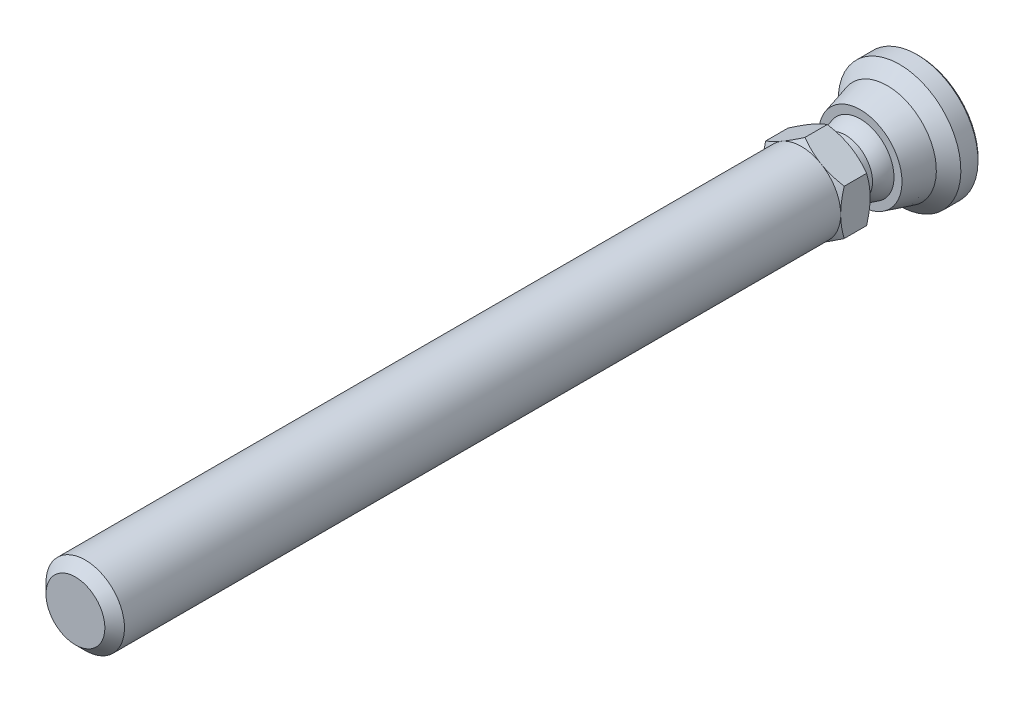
ISO-10303-21;
HEADER;
FILE_DESCRIPTION(('STEP AP214'),'2;1');
FILE_NAME('part.step','',(''),(''),'','','');
FILE_SCHEMA(('AUTOMOTIVE_DESIGN { 1 0 10303 214 1 1 1 1 }'));
ENDSEC;
DATA;
#1=APPLICATION_CONTEXT('core data for automotive mechanical design processes');
#2=APPLICATION_PROTOCOL_DEFINITION('international standard','automotive_design',2000,#1);
#3=PRODUCT_CONTEXT('',#1,'mechanical');
#4=PRODUCT('Part','Part','',(#3));
#5=PRODUCT_RELATED_PRODUCT_CATEGORY('part','',(#4));
#6=PRODUCT_DEFINITION_FORMATION('','',#4);
#7=PRODUCT_DEFINITION_CONTEXT('part definition',#1,'design');
#8=PRODUCT_DEFINITION('design','',#6,#7);
#9=PRODUCT_DEFINITION_SHAPE('','',#8);
#10=(LENGTH_UNIT() NAMED_UNIT(*) SI_UNIT(.MILLI.,.METRE.));
#11=(NAMED_UNIT(*) PLANE_ANGLE_UNIT() SI_UNIT($,.RADIAN.));
#12=(NAMED_UNIT(*) SI_UNIT($,.STERADIAN.) SOLID_ANGLE_UNIT());
#13=UNCERTAINTY_MEASURE_WITH_UNIT(LENGTH_MEASURE(1.E-05),#10,'distance_accuracy_value','');
#14=(GEOMETRIC_REPRESENTATION_CONTEXT(3) GLOBAL_UNCERTAINTY_ASSIGNED_CONTEXT((#13)) GLOBAL_UNIT_ASSIGNED_CONTEXT((#10,
#11,#12)) REPRESENTATION_CONTEXT('',''));
#15=CARTESIAN_POINT('',(0.,0.,0.));
#16=DIRECTION('',(0.,0.,1.));
#17=DIRECTION('',(1.,0.,0.));
#18=AXIS2_PLACEMENT_3D('',#15,#16,#17);
#19=CARTESIAN_POINT('',(-7.7647058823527,0.,17.9999999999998));
#20=DIRECTION('',(0.,0.,1.));
#21=DIRECTION('',(0.,-1.,0.));
#22=AXIS2_PLACEMENT_3D('',#19,#20,#21);
#23=PLANE('',#22);
#24=CARTESIAN_POINT('',(0.,0.,17.9999999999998));
#25=DIRECTION('',(0.,0.,-1.));
#26=DIRECTION('',(0.,1.,0.));
#27=AXIS2_PLACEMENT_3D('',#24,#25,#26);
#28=CIRCLE('',#27,5.49999999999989);
#29=CARTESIAN_POINT('',(0.,5.49999999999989,17.9999999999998));
#30=VERTEX_POINT('',#29);
#31=EDGE_CURVE('E378',#30,#30,#28,.T.);
#32=ORIENTED_EDGE('',*,*,#31,.F.);
#33=EDGE_LOOP('',(#32));
#34=FACE_BOUND('',#33,.T.);
#35=CARTESIAN_POINT('',(0.,0.,17.9999999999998));
#36=DIRECTION('',(0.,0.,1.));
#37=DIRECTION('',(0.,-1.,0.));
#38=AXIS2_PLACEMENT_3D('',#35,#36,#37);
#39=CIRCLE('',#38,7.99999999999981);
#40=CARTESIAN_POINT('',(-4.,-6.92820323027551,17.9999999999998));
#41=VERTEX_POINT('',#40);
#42=CARTESIAN_POINT('',(4.,-6.92820323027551,17.9999999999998));
#43=VERTEX_POINT('',#42);
#44=EDGE_CURVE('E106',#41,#43,#39,.T.);
#45=ORIENTED_EDGE('',*,*,#44,.F.);
#46=CARTESIAN_POINT('',(-8.,0.,17.9999999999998));
#47=VERTEX_POINT('',#46);
#48=EDGE_CURVE('E117',#47,#41,#39,.T.);
#49=ORIENTED_EDGE('',*,*,#48,.F.);
#50=CARTESIAN_POINT('',(-4.,6.92820323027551,17.9999999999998));
#51=VERTEX_POINT('',#50);
#52=EDGE_CURVE('E413',#51,#47,#39,.T.);
#53=ORIENTED_EDGE('',*,*,#52,.F.);
#54=CARTESIAN_POINT('',(4.,6.92820323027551,17.9999999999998));
#55=VERTEX_POINT('',#54);
#56=EDGE_CURVE('E34',#55,#51,#39,.T.);
#57=ORIENTED_EDGE('',*,*,#56,.F.);
#58=CARTESIAN_POINT('',(8.,0.,17.9999999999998));
#59=VERTEX_POINT('',#58);
#60=EDGE_CURVE('E140',#59,#55,#39,.T.);
#61=ORIENTED_EDGE('',*,*,#60,.F.);
#62=EDGE_CURVE('E119',#43,#59,#39,.T.);
#63=ORIENTED_EDGE('',*,*,#62,.F.);
#64=EDGE_LOOP('',(#45,#49,#53,#57,#61,#63));
#65=FACE_BOUND('',#64,.T.);
#66=ADVANCED_FACE('F14',(#34,#65),#23,.F.);
#67=CARTESIAN_POINT('',(0.,0.,0.));
#68=DIRECTION('',(0.,0.,-1.));
#69=DIRECTION('',(0.,1.,0.));
#70=AXIS2_PLACEMENT_3D('',#67,#68,#69);
#71=CYLINDRICAL_SURFACE('',#70,5.49999999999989);
#72=CARTESIAN_POINT('',(0.,0.,15.));
#73=DIRECTION('',(0.,0.,-1.));
#74=DIRECTION('',(0.,1.,0.));
#75=AXIS2_PLACEMENT_3D('',#72,#73,#74);
#76=CIRCLE('',#75,5.49999999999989);
#77=CARTESIAN_POINT('',(-5.49999999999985,0.,15.));
#78=VERTEX_POINT('',#77);
#79=EDGE_CURVE('E375',#78,#78,#76,.T.);
#80=ORIENTED_EDGE('',*,*,#79,.F.);
#81=EDGE_LOOP('',(#80));
#82=FACE_BOUND('',#81,.T.);
#83=ORIENTED_EDGE('',*,*,#31,.T.);
#84=EDGE_LOOP('',(#83));
#85=FACE_BOUND('',#84,.T.);
#86=ADVANCED_FACE('F260',(#82,#85),#71,.T.);
#87=CARTESIAN_POINT('',(1.11022302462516E-13,0.,10.6698729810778));
#88=DIRECTION('',(0.,0.,-1.));
#89=DIRECTION('',(-1.,0.,0.));
#90=AXIS2_PLACEMENT_3D('',#87,#88,#89);
#91=SPHERICAL_SURFACE('',#90,7.);
#92=CARTESIAN_POINT('',(0.,0.,12.));
#93=DIRECTION('',(0.,0.,-1.));
#94=DIRECTION('',(0.,1.,0.));
#95=AXIS2_PLACEMENT_3D('',#92,#93,#94);
#96=CIRCLE('',#95,6.87246404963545);
#97=CARTESIAN_POINT('',(-6.87246404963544,0.,12.));
#98=VERTEX_POINT('',#97);
#99=EDGE_CURVE('E372',#98,#98,#96,.T.);
#100=CARTESIAN_POINT('',(-6.87246404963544,0.,12.));
#101=CARTESIAN_POINT('',(-6.86587210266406,0.,12.0340591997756));
#102=CARTESIAN_POINT('',(-6.85902692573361,0.,12.0680693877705));
#103=CARTESIAN_POINT('',(-6.84483171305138,0.,12.1359842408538));
#104=CARTESIAN_POINT('',(-6.8374816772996,0.,12.1698889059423));
#105=CARTESIAN_POINT('',(-6.82227834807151,0.,12.2375852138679));
#106=CARTESIAN_POINT('',(-6.81442505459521,0.,12.2713768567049));
#107=CARTESIAN_POINT('',(-6.79821695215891,0.,12.3388396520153));
#108=CARTESIAN_POINT('',(-6.78986214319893,0.,12.3725108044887));
#109=CARTESIAN_POINT('',(-6.77265285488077,0.,12.4397251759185));
#110=CARTESIAN_POINT('',(-6.7637983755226,0.,12.473268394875));
#111=CARTESIAN_POINT('',(-6.74559170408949,0.,12.5402194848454));
#112=CARTESIAN_POINT('',(-6.73623951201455,0.,12.5736273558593));
#113=CARTESIAN_POINT('',(-6.71703948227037,0.,12.6403003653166));
#114=CARTESIAN_POINT('',(-6.70719164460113,0.,12.67356550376));
#115=CARTESIAN_POINT('',(-6.68700250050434,0.,12.7399456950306));
#116=CARTESIAN_POINT('',(-6.67666119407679,0.,12.7730607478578));
#117=CARTESIAN_POINT('',(-6.65548739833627,0.,12.8391334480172));
#118=CARTESIAN_POINT('',(-6.64465490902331,0.,12.8720910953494));
#119=CARTESIAN_POINT('',(-6.62250114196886,0.,12.9378416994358));
#120=CARTESIAN_POINT('',(-6.61117986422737,0.,12.9706346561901));
#121=CARTESIAN_POINT('',(-6.58805102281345,0.,13.0360486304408));
#122=CARTESIAN_POINT('',(-6.57624345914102,0.,13.0686696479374));
#123=CARTESIAN_POINT('',(-6.55214465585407,0.,13.1337325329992));
#124=CARTESIAN_POINT('',(-6.53985341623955,0.,13.1661744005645));
#125=CARTESIAN_POINT('',(-6.51478997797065,0.,13.2308718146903));
#126=CARTESIAN_POINT('',(-6.50201777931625,0.,13.2631273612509));
#127=CARTESIAN_POINT('',(-6.47599524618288,0.,13.3274450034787));
#128=CARTESIAN_POINT('',(-6.46274491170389,0.,13.3595070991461));
#129=CARTESIAN_POINT('',(-6.43576903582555,0.,13.4234307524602));
#130=CARTESIAN_POINT('',(-6.4220434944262,0.,13.455292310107));
#131=CARTESIAN_POINT('',(-6.39412023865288,0.,13.5188078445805));
#132=CARTESIAN_POINT('',(-6.37992252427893,0.,13.5504618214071));
#133=CARTESIAN_POINT('',(-6.35105806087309,0.,13.6135551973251));
#134=CARTESIAN_POINT('',(-6.3363913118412,0.,13.6449945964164));
#135=CARTESIAN_POINT('',(-6.30659202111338,0.,13.7076518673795));
#136=CARTESIAN_POINT('',(-6.29145947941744,0.,13.7388697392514));
#137=CARTESIAN_POINT('',(-6.26073194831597,0.,13.8010770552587));
#138=CARTESIAN_POINT('',(-6.24513695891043,0.,13.8320664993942));
#139=CARTESIAN_POINT('',(-6.21348797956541,0.,13.8938101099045));
#140=CARTESIAN_POINT('',(-6.19743398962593,0.,13.9245642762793));
#141=CARTESIAN_POINT('',(-6.16487055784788,0.,13.9858305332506));
#142=CARTESIAN_POINT('',(-6.14836111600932,0.,14.016342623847));
#143=CARTESIAN_POINT('',(-6.11489042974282,0.,14.0771179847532));
#144=CARTESIAN_POINT('',(-6.09792918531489,0.,14.107381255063));
#145=CARTESIAN_POINT('',(-6.06355864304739,0.,14.1676522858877));
#146=CARTESIAN_POINT('',(-6.04614934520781,0.,14.1976600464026));
#147=CARTESIAN_POINT('',(-6.01088654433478,0.,14.2574134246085));
#148=CARTESIAN_POINT('',(-5.99303304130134,0.,14.2871590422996));
#149=CARTESIAN_POINT('',(-5.95688577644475,0.,14.3463815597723));
#150=CARTESIAN_POINT('',(-5.93859201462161,0.,14.3758584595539));
#151=CARTESIAN_POINT('',(-5.90156827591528,0.,14.4345370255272));
#152=CARTESIAN_POINT('',(-5.88283829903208,0.,14.4637386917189));
#153=CARTESIAN_POINT('',(-5.84494627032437,0.,14.5218603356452));
#154=CARTESIAN_POINT('',(-5.82578421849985,0.,14.5507803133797));
#155=CARTESIAN_POINT('',(-5.78703227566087,0.,14.6083321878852));
#156=CARTESIAN_POINT('',(-5.76744238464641,0.,14.6369640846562));
#157=CARTESIAN_POINT('',(-5.72783909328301,0.,14.6939334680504));
#158=CARTESIAN_POINT('',(-5.70782569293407,0.,14.7222709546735));
#159=CARTESIAN_POINT('',(-5.66737980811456,0.,14.778645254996));
#160=CARTESIAN_POINT('',(-5.64694732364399,0.,14.8066820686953));
#161=CARTESIAN_POINT('',(-5.60566778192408,0.,14.862448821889));
#162=CARTESIAN_POINT('',(-5.58482072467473,0.,14.8901787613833));
#163=CARTESIAN_POINT('',(-5.54271666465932,0.,14.9453256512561));
#164=CARTESIAN_POINT('',(-5.52145966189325,0.,14.9727426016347));
#165=CARTESIAN_POINT('',(-5.49999999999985,0.,15.));
#166=B_SPLINE_CURVE_WITH_KNOTS('',3,(#100,#101,#102,#103,#104,#105,#106,#107,#108,#109,#110,
#111,#112,#113,#114,#115,#116,#117,#118,#119,#120,#121,#122,#123,#124,#125,#126,#127,#128,#129,
#130,#131,#132,#133,#134,#135,#136,#137,#138,#139,#140,#141,#142,#143,#144,#145,#146,#147,#148,
#149,#150,#151,#152,#153,#154,#155,#156,#157,#158,#159,#160,#161,#162,#163,#164,#165),
.UNSPECIFIED.,.F.,.F.,(4,2,2,2,2,2,2,2,2,2,2,2,2,2,2,2,2,2,2,2,2,2,2,2,2,2,2,2,2,2,2,2,4),(0.,
0.104072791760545,0.208145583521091,0.312218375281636,0.416291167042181,0.520363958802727,
0.624436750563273,0.728509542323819,0.832582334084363,0.936655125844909,1.04072791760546,
1.144800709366,1.24887350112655,1.35294629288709,1.45701908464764,1.56109187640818,
1.66516466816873,1.76923745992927,1.87331025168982,1.97738304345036,2.08145583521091,
2.18552862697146,2.289601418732,2.39367421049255,2.49774700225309,2.60181979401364,
2.70589258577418,2.80996537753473,2.91403816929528,3.01811096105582,3.12218375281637,
3.22625654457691,3.33032933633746),.UNSPECIFIED.);
#167=EDGE_CURVE('BSEAM256',#98,#78,#166,.T.);
#168=ORIENTED_EDGE('',*,*,#99,.F.);
#169=ORIENTED_EDGE('',*,*,#79,.T.);
#170=ORIENTED_EDGE('',*,*,#167,.T.);
#171=ORIENTED_EDGE('',*,*,#167,.F.);
#172=EDGE_LOOP('',(#168,#170,#169,#171));
#173=FACE_BOUND('',#172,.T.);
#174=ADVANCED_FACE('F256',(#173),#91,.T.);
#175=CARTESIAN_POINT('',(-8.5,0.,12.));
#176=DIRECTION('',(0.,0.,-1.));
#177=DIRECTION('',(0.,1.,0.));
#178=AXIS2_PLACEMENT_3D('',#175,#176,#177);
#179=PLANE('',#178);
#180=CARTESIAN_POINT('',(0.,0.,12.));
#181=DIRECTION('',(0.,0.,-1.));
#182=DIRECTION('',(0.,1.,0.));
#183=AXIS2_PLACEMENT_3D('',#180,#181,#182);
#184=CIRCLE('',#183,8.5);
#185=CARTESIAN_POINT('',(0.,8.5,12.));
#186=VERTEX_POINT('',#185);
#187=EDGE_CURVE('E369',#186,#186,#184,.T.);
#188=ORIENTED_EDGE('',*,*,#187,.F.);
#189=EDGE_LOOP('',(#188));
#190=FACE_BOUND('',#189,.T.);
#191=ORIENTED_EDGE('',*,*,#99,.T.);
#192=EDGE_LOOP('',(#191));
#193=FACE_BOUND('',#192,.T.);
#194=ADVANCED_FACE('F252',(#190,#193),#179,.F.);
#195=CARTESIAN_POINT('',(0.,0.,12.));
#196=DIRECTION('',(0.,0.,-1.));
#197=DIRECTION('',(0.,1.,0.));
#198=AXIS2_PLACEMENT_3D('',#195,#196,#197);
#199=CONICAL_SURFACE('',#198,8.5,0.266252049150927);
#200=CARTESIAN_POINT('',(0.,0.,6.5));
#201=DIRECTION('',(0.,0.,-1.));
#202=DIRECTION('',(0.,1.,0.));
#203=AXIS2_PLACEMENT_3D('',#200,#201,#202);
#204=CIRCLE('',#203,10.);
#205=CARTESIAN_POINT('',(0.,10.,6.5));
#206=VERTEX_POINT('',#205);
#207=EDGE_CURVE('E366',#206,#206,#204,.T.);
#208=ORIENTED_EDGE('',*,*,#207,.F.);
#209=EDGE_LOOP('',(#208));
#210=FACE_BOUND('',#209,.T.);
#211=ORIENTED_EDGE('',*,*,#187,.T.);
#212=EDGE_LOOP('',(#211));
#213=FACE_BOUND('',#212,.T.);
#214=ADVANCED_FACE('F248',(#210,#213),#199,.T.);
#215=CARTESIAN_POINT('',(0.,0.,6.5));
#216=DIRECTION('',(0.,0.,-1.));
#217=DIRECTION('',(0.,1.,0.));
#218=AXIS2_PLACEMENT_3D('',#215,#216,#217);
#219=CONICAL_SURFACE('',#218,10.,0.785398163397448);
#220=CARTESIAN_POINT('',(0.,0.,4.));
#221=DIRECTION('',(0.,0.,-1.));
#222=DIRECTION('',(0.,1.,0.));
#223=AXIS2_PLACEMENT_3D('',#220,#221,#222);
#224=CIRCLE('',#223,12.5);
#225=CARTESIAN_POINT('',(0.,12.5,4.));
#226=VERTEX_POINT('',#225);
#227=EDGE_CURVE('E363',#226,#226,#224,.T.);
#228=ORIENTED_EDGE('',*,*,#227,.F.);
#229=EDGE_LOOP('',(#228));
#230=FACE_BOUND('',#229,.T.);
#231=ORIENTED_EDGE('',*,*,#207,.T.);
#232=EDGE_LOOP('',(#231));
#233=FACE_BOUND('',#232,.T.);
#234=ADVANCED_FACE('F244',(#230,#233),#219,.T.);
#235=CARTESIAN_POINT('',(0.,0.,0.));
#236=DIRECTION('',(0.,0.,-1.));
#237=DIRECTION('',(0.,1.,0.));
#238=AXIS2_PLACEMENT_3D('',#235,#236,#237);
#239=CYLINDRICAL_SURFACE('',#238,12.5);
#240=CARTESIAN_POINT('',(0.,0.,0.5));
#241=DIRECTION('',(0.,0.,-1.));
#242=DIRECTION('',(0.,1.,0.));
#243=AXIS2_PLACEMENT_3D('',#240,#241,#242);
#244=CIRCLE('',#243,12.5);
#245=CARTESIAN_POINT('',(0.,12.5,0.5));
#246=VERTEX_POINT('',#245);
#247=EDGE_CURVE('E360',#246,#246,#244,.T.);
#248=ORIENTED_EDGE('',*,*,#247,.F.);
#249=EDGE_LOOP('',(#248));
#250=FACE_BOUND('',#249,.T.);
#251=ORIENTED_EDGE('',*,*,#227,.T.);
#252=EDGE_LOOP('',(#251));
#253=FACE_BOUND('',#252,.T.);
#254=ADVANCED_FACE('F240',(#250,#253),#239,.T.);
#255=CARTESIAN_POINT('',(0.,0.,0.5));
#256=DIRECTION('',(0.,0.,1.));
#257=DIRECTION('',(0.,-1.,0.));
#258=AXIS2_PLACEMENT_3D('',#255,#256,#257);
#259=CONICAL_SURFACE('',#258,12.5,0.785398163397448);
#260=CARTESIAN_POINT('',(0.,0.,0.));
#261=DIRECTION('',(0.,0.,-1.));
#262=DIRECTION('',(0.,1.,0.));
#263=AXIS2_PLACEMENT_3D('',#260,#261,#262);
#264=CIRCLE('',#263,12.);
#265=CARTESIAN_POINT('',(0.,12.,0.));
#266=VERTEX_POINT('',#265);
#267=EDGE_CURVE('E357',#266,#266,#264,.T.);
#268=ORIENTED_EDGE('',*,*,#267,.F.);
#269=EDGE_LOOP('',(#268));
#270=FACE_BOUND('',#269,.T.);
#271=ORIENTED_EDGE('',*,*,#247,.T.);
#272=EDGE_LOOP('',(#271));
#273=FACE_BOUND('',#272,.T.);
#274=ADVANCED_FACE('F236',(#270,#273),#259,.T.);
#275=CARTESIAN_POINT('',(-12.,0.,0.));
#276=DIRECTION('',(0.,0.,1.));
#277=DIRECTION('',(0.,-1.,0.));
#278=AXIS2_PLACEMENT_3D('',#275,#276,#277);
#279=PLANE('',#278);
#280=ORIENTED_EDGE('',*,*,#267,.T.);
#281=EDGE_LOOP('',(#280));
#282=FACE_BOUND('',#281,.T.);
#283=ADVANCED_FACE('F163',(#282),#279,.F.);
#284=CARTESIAN_POINT('',(0.,0.,17.9999999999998));
#285=DIRECTION('',(0.,0.,1.));
#286=DIRECTION('',(0.,-1.,0.));
#287=AXIS2_PLACEMENT_3D('',#284,#285,#286);
#288=CONICAL_SURFACE('',#287,7.99999999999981,1.0471975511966);
#289=CARTESIAN_POINT('',(8.,12.3824967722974,21.8924889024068));
#290=CARTESIAN_POINT('',(8.,12.0332926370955,21.7231909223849));
#291=CARTESIAN_POINT('',(8.,11.6832842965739,21.555523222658));
#292=CARTESIAN_POINT('',(8.,10.9812314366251,21.2243657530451));
#293=CARTESIAN_POINT('',(8.,10.6291866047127,21.0608766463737));
#294=CARTESIAN_POINT('',(8.,9.92080746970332,20.7381660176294));
#295=CARTESIAN_POINT('',(8.,9.56446023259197,20.5789727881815));
#296=CARTESIAN_POINT('',(8.,8.84892315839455,20.2671332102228));
#297=CARTESIAN_POINT('',(8.,8.4897334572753,20.1144865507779));
#298=CARTESIAN_POINT('',(8.,7.75642586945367,19.8127312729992));
#299=CARTESIAN_POINT('',(8.,7.38219711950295,19.6638905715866));
#300=CARTESIAN_POINT('',(8.,6.62935333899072,19.3775325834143));
#301=CARTESIAN_POINT('',(8.,6.25073782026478,19.2400165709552));
#302=CARTESIAN_POINT('',(8.,5.48923013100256,18.9799362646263));
#303=CARTESIAN_POINT('',(8.,5.10634848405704,18.8573414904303));
#304=CARTESIAN_POINT('',(8.,4.3351068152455,18.6310518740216));
#305=CARTESIAN_POINT('',(8.,3.94674856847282,18.5273510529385));
#306=CARTESIAN_POINT('',(8.,3.16642683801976,18.344400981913));
#307=CARTESIAN_POINT('',(8.,2.77449519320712,18.2650196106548));
#308=CARTESIAN_POINT('',(8.,2.18304799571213,18.1676341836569));
#309=CARTESIAN_POINT('',(8.,1.98529256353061,18.1387854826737));
#310=CARTESIAN_POINT('',(8.,1.5888069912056,18.0888833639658));
#311=CARTESIAN_POINT('',(8.,1.39007694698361,18.0678291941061));
#312=CARTESIAN_POINT('',(8.,0.994493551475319,18.0341983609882));
#313=CARTESIAN_POINT('',(8.,0.797649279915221,18.0215153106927));
#314=CARTESIAN_POINT('',(8.,0.403600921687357,18.0044830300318));
#315=CARTESIAN_POINT('',(8.,0.206396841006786,18.000133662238));
#316=CARTESIAN_POINT('',(8.,-0.188018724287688,17.9998724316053));
#317=CARTESIAN_POINT('',(8.,-0.385230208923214,18.0039605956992));
#318=CARTESIAN_POINT('',(8.,-0.779306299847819,18.0204749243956));
#319=CARTESIAN_POINT('',(8.,-0.976170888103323,18.0329015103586));
#320=CARTESIAN_POINT('',(8.,-1.45004343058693,18.0725873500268));
#321=CARTESIAN_POINT('',(8.,-1.72672356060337,18.1038444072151));
#322=CARTESIAN_POINT('',(8.,-2.27800126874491,18.181117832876));
#323=CARTESIAN_POINT('',(8.,-2.55259855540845,18.227136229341));
#324=CARTESIAN_POINT('',(8.,-3.37296943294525,18.3848907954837));
#325=CARTESIAN_POINT('',(8.,-3.91500902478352,18.516296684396));
#326=CARTESIAN_POINT('',(8.,-4.72544477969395,18.7437972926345));
#327=CARTESIAN_POINT('',(8.,-4.99805434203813,18.8257426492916));
#328=CARTESIAN_POINT('',(8.,-5.54062519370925,18.9980538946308));
#329=CARTESIAN_POINT('',(8.,-5.81058646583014,19.0884198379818));
#330=CARTESIAN_POINT('',(8.,-6.34794713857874,19.2761299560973));
#331=CARTESIAN_POINT('',(8.,-6.6153473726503,19.3734717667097));
#332=CARTESIAN_POINT('',(8.,-7.14793876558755,19.5739973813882));
#333=CARTESIAN_POINT('',(8.,-7.41312994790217,19.6771811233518));
#334=CARTESIAN_POINT('',(8.,-8.02881120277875,19.923302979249));
#335=CARTESIAN_POINT('',(8.,-8.37854996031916,20.0681168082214));
#336=CARTESIAN_POINT('',(8.,-9.07512927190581,20.3645741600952));
#337=CARTESIAN_POINT('',(8.,-9.42196966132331,20.5162180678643));
#338=CARTESIAN_POINT('',(8.,-10.1132710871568,20.8249936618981));
#339=CARTESIAN_POINT('',(8.,-10.457731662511,20.9821263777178));
#340=CARTESIAN_POINT('',(8.,-11.1446087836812,21.3008053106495));
#341=CARTESIAN_POINT('',(8.,-11.4870252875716,21.4623516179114));
#342=CARTESIAN_POINT('',(8.,-12.1704822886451,21.789208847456));
#343=CARTESIAN_POINT('',(8.,-12.5115210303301,21.954523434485));
#344=CARTESIAN_POINT('',(8.,-13.1921405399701,22.2881298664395));
#345=CARTESIAN_POINT('',(8.,-13.5317212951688,22.4564217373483));
#346=CARTESIAN_POINT('',(8.,-14.5485332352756,22.9649439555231));
#347=CARTESIAN_POINT('',(8.,-15.2239198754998,23.3088622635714));
#348=CARTESIAN_POINT('',(8.,-16.5162228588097,23.9753589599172));
#349=CARTESIAN_POINT('',(8.,-17.133420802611,24.297393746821));
#350=CARTESIAN_POINT('',(8.,-18.3655012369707,24.9459084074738));
#351=CARTESIAN_POINT('',(7.99999999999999,-18.9803836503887,25.2723884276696));
#352=CARTESIAN_POINT('',(7.99999999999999,-20.2068654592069,25.9279592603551));
#353=CARTESIAN_POINT('',(7.99999999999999,-20.8184691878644,26.2570419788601));
#354=CARTESIAN_POINT('',(7.99999999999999,-22.0401897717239,26.9178800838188));
#355=CARTESIAN_POINT('',(8.,-22.6503067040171,27.2496353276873));
#356=CARTESIAN_POINT('',(8.,-23.2598734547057,27.5823916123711));
#357=B_SPLINE_CURVE_WITH_KNOTS('',3,(#289,#290,#291,#292,#293,#294,#295,#296,#297,#298,#299,
#300,#301,#302,#303,#304,#305,#306,#307,#308,#309,#310,#311,#312,#313,#314,#315,#316,#317,#318,
#319,#320,#321,#322,#323,#324,#325,#326,#327,#328,#329,#330,#331,#332,#333,#334,#335,#336,#337,
#338,#339,#340,#341,#342,#343,#344,#345,#346,#347,#348,#349,#350,#351,#352,#353,#354,#355,#356),
.UNSPECIFIED.,.F.,.F.,(4,2,2,2,2,2,2,2,2,2,2,2,2,2,2,2,2,2,2,2,2,2,2,2,2,2,2,2,2,2,2,2,2,4),(0.,
1.16425142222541,2.32868649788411,3.49950202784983,4.67026188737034,5.87834417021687,
7.08656220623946,8.29226919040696,9.49759397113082,10.6962494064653,11.2956657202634,
11.8950241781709,12.486610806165,13.0781876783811,13.669766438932,14.261375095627,
15.0962231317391,15.9311859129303,17.6020505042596,18.4559588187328,19.3098726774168,
20.1634984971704,21.0171152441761,22.1526216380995,23.2881920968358,24.4239767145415,
25.5597845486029,26.6967485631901,27.8337225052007,30.1073847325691,32.1958474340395,
34.2843791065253,36.3679245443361,38.4513595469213),.UNSPECIFIED.);
#358=CARTESIAN_POINT('',(8.,4.61880215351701,18.7145311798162));
#359=VERTEX_POINT('',#358);
#360=EDGE_CURVE('E141',#359,#59,#357,.T.);
#361=ORIENTED_EDGE('',*,*,#360,.T.);
#362=ORIENTED_EDGE('',*,*,#60,.T.);
#363=CARTESIAN_POINT('',(-0.000199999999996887,9.23771977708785,18.7145978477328));
#364=CARTESIAN_POINT('',(0.175648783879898,9.13619343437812,18.6559907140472));
#365=CARTESIAN_POINT('',(0.352153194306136,9.03428856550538,18.6000434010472));
#366=CARTESIAN_POINT('',(0.706595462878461,8.82965122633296,18.4942010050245));
#367=CARTESIAN_POINT('',(0.884533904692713,8.72691841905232,18.4443085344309));
#368=CARTESIAN_POINT('',(1.42119823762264,8.41707512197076,18.3046927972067));
#369=CARTESIAN_POINT('',(1.78204258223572,8.20874154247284,18.2252811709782));
#370=CARTESIAN_POINT('',(2.32203917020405,7.89697436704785,18.1321616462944));
#371=CARTESIAN_POINT('',(2.49957818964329,7.79447216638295,18.105634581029));
#372=CARTESIAN_POINT('',(2.8554591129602,7.58900421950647,18.0611531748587));
#373=CARTESIAN_POINT('',(3.03380094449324,7.4860385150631,18.0431980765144));
#374=CARTESIAN_POINT('',(3.39079168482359,7.27992981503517,18.0163156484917));
#375=CARTESIAN_POINT('',(3.5694400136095,7.17678715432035,18.0073780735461));
#376=CARTESIAN_POINT('',(3.92690170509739,6.97040655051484,17.998722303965));
#377=CARTESIAN_POINT('',(4.10571506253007,6.86716861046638,17.9990038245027));
#378=CARTESIAN_POINT('',(4.44001336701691,6.67416139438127,18.0081450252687));
#379=CARTESIAN_POINT('',(4.59552190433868,6.58437849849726,18.0158896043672));
#380=CARTESIAN_POINT('',(4.90617476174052,6.40502298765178,18.0382011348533));
#381=CARTESIAN_POINT('',(5.06131905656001,6.31545038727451,18.052768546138));
#382=CARTESIAN_POINT('',(5.52615131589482,6.04707935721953,18.1063606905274));
#383=CARTESIAN_POINT('',(5.83501648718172,5.86875596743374,18.155268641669));
#384=CARTESIAN_POINT('',(6.4560232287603,5.51021755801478,18.2775394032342));
#385=CARTESIAN_POINT('',(6.76808554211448,5.3300482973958,18.3514205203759));
#386=CARTESIAN_POINT('',(7.38755648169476,4.97239658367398,18.5191001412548));
#387=CARTESIAN_POINT('',(7.69497304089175,4.79490955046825,18.6128592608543));
#388=CARTESIAN_POINT('',(8.0002,4.61868668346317,18.7145978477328));
#389=B_SPLINE_CURVE_WITH_KNOTS('',3,(#363,#364,#365,#366,#367,#368,#369,#370,#371,#372,#373,
#374,#375,#376,#377,#378,#379,#380,#381,#382,#383,#384,#385,#386,#387,#388),.UNSPECIFIED.,.F.,
.F.,(4,2,2,2,2,2,2,2,2,2,2,2,4),(0.,0.633973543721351,1.26821965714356,2.53934712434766,
3.15934343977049,3.77928496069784,4.39852133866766,5.01773858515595,5.55680239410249,
6.09590254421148,7.17487077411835,8.27776850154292,9.37850115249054),.UNSPECIFIED.);
#390=EDGE_CURVE('E18',#55,#359,#389,.T.);
#391=ORIENTED_EDGE('',*,*,#390,.T.);
#392=EDGE_LOOP('',(#361,#362,#391));
#393=FACE_BOUND('',#392,.T.);
#394=ADVANCED_FACE('F158',(#393),#288,.T.);
#395=CARTESIAN_POINT('',(-8.0002,4.61868668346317,18.7145978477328));
#396=CARTESIAN_POINT('',(-7.82435121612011,4.7202130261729,18.6559907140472));
#397=CARTESIAN_POINT('',(-7.64784680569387,4.82211789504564,18.6000434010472));
#398=CARTESIAN_POINT('',(-7.29340453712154,5.02675523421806,18.4942010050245));
#399=CARTESIAN_POINT('',(-7.11546609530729,5.1294880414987,18.4443085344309));
#400=CARTESIAN_POINT('',(-6.57880176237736,5.43933133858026,18.3046927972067));
#401=CARTESIAN_POINT('',(-6.21795741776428,5.64766491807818,18.2252811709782));
#402=CARTESIAN_POINT('',(-5.67796082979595,5.95943209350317,18.1321616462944));
#403=CARTESIAN_POINT('',(-5.50042181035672,6.06193429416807,18.105634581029));
#404=CARTESIAN_POINT('',(-5.14454088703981,6.26740224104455,18.0611531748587));
#405=CARTESIAN_POINT('',(-4.96619905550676,6.37036794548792,18.0431980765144));
#406=CARTESIAN_POINT('',(-4.60920831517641,6.57647664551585,18.0163156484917));
#407=CARTESIAN_POINT('',(-4.4305599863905,6.67961930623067,18.0073780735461));
#408=CARTESIAN_POINT('',(-4.07309829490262,6.88599991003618,17.998722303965));
#409=CARTESIAN_POINT('',(-3.89428493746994,6.98923785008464,17.9990038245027));
#410=CARTESIAN_POINT('',(-3.5599866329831,7.18224506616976,18.0081450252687));
#411=CARTESIAN_POINT('',(-3.40447809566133,7.27202796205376,18.0158896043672));
#412=CARTESIAN_POINT('',(-3.09382523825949,7.45138347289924,18.0382011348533));
#413=CARTESIAN_POINT('',(-2.93868094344,7.54095607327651,18.052768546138));
#414=CARTESIAN_POINT('',(-2.47384868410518,7.80932710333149,18.1063606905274));
#415=CARTESIAN_POINT('',(-2.16498351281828,7.98765049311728,18.155268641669));
#416=CARTESIAN_POINT('',(-1.5439767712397,8.34618890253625,18.2775394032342));
#417=CARTESIAN_POINT('',(-1.23191445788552,8.52635816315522,18.3514205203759));
#418=CARTESIAN_POINT('',(-0.612443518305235,8.88400987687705,18.5191001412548));
#419=CARTESIAN_POINT('',(-0.305026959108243,9.06149691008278,18.6128592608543));
#420=CARTESIAN_POINT('',(0.00020000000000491,9.23771977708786,18.7145978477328));
#421=B_SPLINE_CURVE_WITH_KNOTS('',3,(#395,#396,#397,#398,#399,#400,#401,#402,#403,#404,#405,
#406,#407,#408,#409,#410,#411,#412,#413,#414,#415,#416,#417,#418,#419,#420),.UNSPECIFIED.,.F.,
.F.,(4,2,2,2,2,2,2,2,2,2,2,2,4),(0.,0.633973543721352,1.26821965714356,2.53934712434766,
3.15934343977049,3.77928496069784,4.39852133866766,5.01773858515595,5.55680239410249,
6.09590254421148,7.17487077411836,8.27776850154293,9.37850115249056),.UNSPECIFIED.);
#422=CARTESIAN_POINT('',(0.,9.23760430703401,18.7145311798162));
#423=VERTEX_POINT('',#422);
#424=EDGE_CURVE('E142',#51,#423,#421,.T.);
#425=ORIENTED_EDGE('',*,*,#424,.T.);
#426=EDGE_CURVE('E9',#423,#55,#389,.T.);
#427=ORIENTED_EDGE('',*,*,#426,.T.);
#428=ORIENTED_EDGE('',*,*,#56,.T.);
#429=EDGE_LOOP('',(#425,#427,#428));
#430=FACE_BOUND('',#429,.T.);
#431=ADVANCED_FACE('F162',(#430),#288,.T.);
#432=CARTESIAN_POINT('',(8.0002,-4.61868668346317,18.7145978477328));
#433=CARTESIAN_POINT('',(7.82435121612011,-4.7202130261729,18.6559907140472));
#434=CARTESIAN_POINT('',(7.64784680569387,-4.82211789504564,18.6000434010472));
#435=CARTESIAN_POINT('',(7.29340453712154,-5.02675523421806,18.4942010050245));
#436=CARTESIAN_POINT('',(7.11546609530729,-5.1294880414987,18.4443085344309));
#437=CARTESIAN_POINT('',(6.57880176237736,-5.43933133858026,18.3046927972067));
#438=CARTESIAN_POINT('',(6.21795741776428,-5.64766491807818,18.2252811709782));
#439=CARTESIAN_POINT('',(5.67796082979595,-5.95943209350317,18.1321616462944));
#440=CARTESIAN_POINT('',(5.50042181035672,-6.06193429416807,18.105634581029));
#441=CARTESIAN_POINT('',(5.14454088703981,-6.26740224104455,18.0611531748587));
#442=CARTESIAN_POINT('',(4.96619905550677,-6.37036794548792,18.0431980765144));
#443=CARTESIAN_POINT('',(4.60920831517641,-6.57647664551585,18.0163156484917));
#444=CARTESIAN_POINT('',(4.4305599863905,-6.67961930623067,18.0073780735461));
#445=CARTESIAN_POINT('',(4.07309829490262,-6.88599991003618,17.998722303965));
#446=CARTESIAN_POINT('',(3.89428493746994,-6.98923785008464,17.9990038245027));
#447=CARTESIAN_POINT('',(3.5599866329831,-7.18224506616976,18.0081450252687));
#448=CARTESIAN_POINT('',(3.40447809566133,-7.27202796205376,18.0158896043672));
#449=CARTESIAN_POINT('',(3.09382523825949,-7.45138347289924,18.0382011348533));
#450=CARTESIAN_POINT('',(2.93868094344,-7.54095607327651,18.052768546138));
#451=CARTESIAN_POINT('',(2.47384868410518,-7.80932710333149,18.1063606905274));
#452=CARTESIAN_POINT('',(2.16498351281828,-7.98765049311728,18.155268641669));
#453=CARTESIAN_POINT('',(1.5439767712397,-8.34618890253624,18.2775394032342));
#454=CARTESIAN_POINT('',(1.23191445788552,-8.52635816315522,18.3514205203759));
#455=CARTESIAN_POINT('',(0.612443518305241,-8.88400987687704,18.5191001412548));
#456=CARTESIAN_POINT('',(0.305026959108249,-9.06149691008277,18.6128592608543));
#457=CARTESIAN_POINT('',(-0.000200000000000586,-9.23771977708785,18.7145978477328));
#458=B_SPLINE_CURVE_WITH_KNOTS('',3,(#432,#433,#434,#435,#436,#437,#438,#439,#440,#441,#442,
#443,#444,#445,#446,#447,#448,#449,#450,#451,#452,#453,#454,#455,#456,#457),.UNSPECIFIED.,.F.,
.F.,(4,2,2,2,2,2,2,2,2,2,2,2,4),(0.,0.633973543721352,1.26821965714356,2.53934712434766,
3.15934343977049,3.77928496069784,4.39852133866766,5.01773858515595,5.55680239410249,
6.09590254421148,7.17487077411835,8.27776850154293,9.37850115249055),.UNSPECIFIED.);
#459=CARTESIAN_POINT('',(8.,-4.61880215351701,18.7145311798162));
#460=VERTEX_POINT('',#459);
#461=EDGE_CURVE('E122',#460,#43,#458,.T.);
#462=ORIENTED_EDGE('',*,*,#461,.T.);
#463=ORIENTED_EDGE('',*,*,#62,.T.);
#464=EDGE_CURVE('E126',#59,#460,#357,.T.);
#465=ORIENTED_EDGE('',*,*,#464,.T.);
#466=EDGE_LOOP('',(#462,#463,#465));
#467=FACE_BOUND('',#466,.T.);
#468=ADVANCED_FACE('F123',(#467),#288,.T.);
#469=CARTESIAN_POINT('',(0.000200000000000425,-9.23771977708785,18.7145978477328));
#470=CARTESIAN_POINT('',(-0.175648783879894,-9.13619343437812,18.6559907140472));
#471=CARTESIAN_POINT('',(-0.352153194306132,-9.03428856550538,18.6000434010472));
#472=CARTESIAN_POINT('',(-0.706595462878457,-8.82965122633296,18.4942010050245));
#473=CARTESIAN_POINT('',(-0.884533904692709,-8.72691841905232,18.4443085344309));
#474=CARTESIAN_POINT('',(-1.42119823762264,-8.41707512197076,18.3046927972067));
#475=CARTESIAN_POINT('',(-1.78204258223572,-8.20874154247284,18.2252811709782));
#476=CARTESIAN_POINT('',(-2.32203917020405,-7.89697436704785,18.1321616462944));
#477=CARTESIAN_POINT('',(-2.49957818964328,-7.79447216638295,18.105634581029));
#478=CARTESIAN_POINT('',(-2.8554591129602,-7.58900421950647,18.0611531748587));
#479=CARTESIAN_POINT('',(-3.03380094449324,-7.4860385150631,18.0431980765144));
#480=CARTESIAN_POINT('',(-3.39079168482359,-7.27992981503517,18.0163156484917));
#481=CARTESIAN_POINT('',(-3.5694400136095,-7.17678715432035,18.0073780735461));
#482=CARTESIAN_POINT('',(-3.92690170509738,-6.97040655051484,17.998722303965));
#483=CARTESIAN_POINT('',(-4.10571506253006,-6.86716861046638,17.9990038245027));
#484=CARTESIAN_POINT('',(-4.4400133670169,-6.67416139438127,18.0081450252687));
#485=CARTESIAN_POINT('',(-4.59552190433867,-6.58437849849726,18.0158896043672));
#486=CARTESIAN_POINT('',(-4.90617476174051,-6.40502298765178,18.0382011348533));
#487=CARTESIAN_POINT('',(-5.06131905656,-6.31545038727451,18.052768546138));
#488=CARTESIAN_POINT('',(-5.52615131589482,-6.04707935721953,18.1063606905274));
#489=CARTESIAN_POINT('',(-5.83501648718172,-5.86875596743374,18.155268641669));
#490=CARTESIAN_POINT('',(-6.4560232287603,-5.51021755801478,18.2775394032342));
#491=CARTESIAN_POINT('',(-6.76808554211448,-5.3300482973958,18.3514205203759));
#492=CARTESIAN_POINT('',(-7.38755648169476,-4.97239658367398,18.5191001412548));
#493=CARTESIAN_POINT('',(-7.69497304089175,-4.79490955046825,18.6128592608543));
#494=CARTESIAN_POINT('',(-8.0002,-4.61868668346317,18.7145978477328));
#495=B_SPLINE_CURVE_WITH_KNOTS('',3,(#469,#470,#471,#472,#473,#474,#475,#476,#477,#478,#479,
#480,#481,#482,#483,#484,#485,#486,#487,#488,#489,#490,#491,#492,#493,#494),.UNSPECIFIED.,.F.,
.F.,(4,2,2,2,2,2,2,2,2,2,2,2,4),(0.,0.633973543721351,1.26821965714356,2.53934712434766,
3.15934343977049,3.77928496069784,4.39852133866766,5.01773858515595,5.55680239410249,
6.09590254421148,7.17487077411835,8.27776850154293,9.37850115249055),.UNSPECIFIED.);
#496=CARTESIAN_POINT('',(0.,-9.23760430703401,18.7145311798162));
#497=VERTEX_POINT('',#496);
#498=EDGE_CURVE('E112',#497,#41,#495,.T.);
#499=ORIENTED_EDGE('',*,*,#498,.T.);
#500=ORIENTED_EDGE('',*,*,#44,.T.);
#501=EDGE_CURVE('E110',#43,#497,#458,.T.);
#502=ORIENTED_EDGE('',*,*,#501,.T.);
#503=EDGE_LOOP('',(#499,#500,#502));
#504=FACE_BOUND('',#503,.T.);
#505=ADVANCED_FACE('F108',(#504),#288,.T.);
#506=CARTESIAN_POINT('',(-8.,-4.618802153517,18.7145311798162));
#507=VERTEX_POINT('',#506);
#508=EDGE_CURVE('E137',#41,#507,#495,.T.);
#509=ORIENTED_EDGE('',*,*,#508,.T.);
#510=CARTESIAN_POINT('',(-8.,12.3824967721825,21.8924889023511));
#511=CARTESIAN_POINT('',(-8.,12.0332926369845,21.7231909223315));
#512=CARTESIAN_POINT('',(-8.,11.6832842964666,21.555523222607));
#513=CARTESIAN_POINT('',(-8.,10.9812314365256,21.2243657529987));
#514=CARTESIAN_POINT('',(-8.,10.6291866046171,21.0608766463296));
#515=CARTESIAN_POINT('',(-8.,9.92080746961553,20.7381660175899));
#516=CARTESIAN_POINT('',(-8.,9.56446023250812,20.5789727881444));
#517=CARTESIAN_POINT('',(-8.,8.8489231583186,20.2671332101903));
#518=CARTESIAN_POINT('',(-8.,8.48973345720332,20.1144865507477));
#519=CARTESIAN_POINT('',(-8.,7.7564258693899,19.8127312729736));
#520=CARTESIAN_POINT('',(-8.,7.38219711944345,19.6638905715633));
#521=CARTESIAN_POINT('',(-8.,6.62935333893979,19.3775325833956));
#522=CARTESIAN_POINT('',(-8.,6.25073782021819,19.2400165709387));
#523=CARTESIAN_POINT('',(-8.,5.4892301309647,18.9799362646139));
#524=CARTESIAN_POINT('',(-8.,5.10634848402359,18.8573414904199));
#525=CARTESIAN_POINT('',(-8.,4.33510681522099,18.631051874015));
#526=CARTESIAN_POINT('',(-8.,3.94674856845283,18.5273510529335));
#527=CARTESIAN_POINT('',(-8.,3.16642683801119,18.3444009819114));
#528=CARTESIAN_POINT('',(-8.,2.77449519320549,18.2650196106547));
#529=CARTESIAN_POINT('',(-8.,2.18304799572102,18.1676341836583));
#530=CARTESIAN_POINT('',(-8.,1.98529256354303,18.1387854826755));
#531=CARTESIAN_POINT('',(-8.,1.5888069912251,18.088883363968));
#532=CARTESIAN_POINT('',(-8.,1.39007694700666,18.0678291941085));
#533=CARTESIAN_POINT('',(-8.,0.994493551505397,18.0341983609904));
#534=CARTESIAN_POINT('',(-8.,0.797649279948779,18.0215153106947));
#535=CARTESIAN_POINT('',(-8.,0.403600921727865,18.0044830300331));
#536=CARTESIAN_POINT('',(-8.,0.206396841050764,18.0001336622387));
#537=CARTESIAN_POINT('',(-8.,-0.188018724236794,17.9998724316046));
#538=CARTESIAN_POINT('',(-8.,-0.385230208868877,18.0039605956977));
#539=CARTESIAN_POINT('',(-8.,-0.779306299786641,18.0204749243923));
#540=CARTESIAN_POINT('',(-8.,-0.976170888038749,18.0329015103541));
#541=CARTESIAN_POINT('',(-8.,-1.45004343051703,18.0725873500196));
#542=CARTESIAN_POINT('',(-8.,-1.72672356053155,18.1038444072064));
#543=CARTESIAN_POINT('',(-8.,-2.27800126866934,18.1811178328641));
#544=CARTESIAN_POINT('',(-8.,-2.55259855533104,18.2271362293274));
#545=CARTESIAN_POINT('',(-8.,-3.37296943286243,18.3848907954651));
#546=CARTESIAN_POINT('',(-8.,-3.91500902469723,18.5162966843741));
#547=CARTESIAN_POINT('',(-8.,-4.72544477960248,18.7437972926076));
#548=CARTESIAN_POINT('',(-8.,-4.9980543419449,18.825742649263));
#549=CARTESIAN_POINT('',(-8.,-5.54062519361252,18.998053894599));
#550=CARTESIAN_POINT('',(-8.,-5.81058646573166,19.0884198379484));
#551=CARTESIAN_POINT('',(-8.,-6.34794713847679,19.2761299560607));
#552=CARTESIAN_POINT('',(-8.,-6.61534737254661,19.3734717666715));
#553=CARTESIAN_POINT('',(-8.,-7.1479387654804,19.573997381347));
#554=CARTESIAN_POINT('',(-8.,-7.41312994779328,19.6771811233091));
#555=CARTESIAN_POINT('',(-8.,-8.02881120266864,19.923302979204));
#556=CARTESIAN_POINT('',(-8.,-8.37854996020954,20.0681168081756));
#557=CARTESIAN_POINT('',(-8.,-9.07512927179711,20.3645741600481));
#558=CARTESIAN_POINT('',(-8.,-9.42196966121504,20.5162180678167));
#559=CARTESIAN_POINT('',(-8.,-10.1132710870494,20.8249936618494));
#560=CARTESIAN_POINT('',(-8.,-10.4577316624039,20.9821263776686));
#561=CARTESIAN_POINT('',(-8.,-11.1446087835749,21.3008053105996));
#562=CARTESIAN_POINT('',(-8.,-11.4870252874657,21.4623516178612));
#563=CARTESIAN_POINT('',(-8.,-12.1704822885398,21.7892088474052));
#564=CARTESIAN_POINT('',(-8.,-12.5115210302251,21.954523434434));
#565=CARTESIAN_POINT('',(-8.,-13.1921405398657,22.288129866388));
#566=CARTESIAN_POINT('',(-8.,-13.5317212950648,22.4564217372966));
#567=CARTESIAN_POINT('',(-8.,-14.5485332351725,22.9649439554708));
#568=CARTESIAN_POINT('',(-8.,-15.2239198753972,23.3088622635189));
#569=CARTESIAN_POINT('',(-8.,-16.5162228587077,23.9753589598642));
#570=CARTESIAN_POINT('',(-8.,-17.1334208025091,24.2973937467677));
#571=CARTESIAN_POINT('',(-8.,-18.3655012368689,24.9459084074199));
#572=CARTESIAN_POINT('',(-8.,-18.9803836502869,25.2723884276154));
#573=CARTESIAN_POINT('',(-8.,-20.2068654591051,25.9279592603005));
#574=CARTESIAN_POINT('',(-8.,-20.8184691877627,26.2570419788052));
#575=CARTESIAN_POINT('',(-8.,-22.0401897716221,26.9178800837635));
#576=CARTESIAN_POINT('',(-8.,-22.6503067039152,27.2496353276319));
#577=CARTESIAN_POINT('',(-8.,-23.2598734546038,27.5823916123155));
#578=B_SPLINE_CURVE_WITH_KNOTS('',3,(#510,#511,#512,#513,#514,#515,#516,#517,#518,#519,#520,
#521,#522,#523,#524,#525,#526,#527,#528,#529,#530,#531,#532,#533,#534,#535,#536,#537,#538,#539,
#540,#541,#542,#543,#544,#545,#546,#547,#548,#549,#550,#551,#552,#553,#554,#555,#556,#557,#558,
#559,#560,#561,#562,#563,#564,#565,#566,#567,#568,#569,#570,#571,#572,#573,#574,#575,#576,#577),
.UNSPECIFIED.,.F.,.F.,(4,2,2,2,2,2,2,2,2,2,2,2,2,2,2,2,2,2,2,2,2,2,2,2,2,2,2,2,2,2,2,2,2,4),(0.,
1.16425142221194,2.32868649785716,3.49950202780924,4.67026188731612,5.87834417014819,
7.08656220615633,8.29226919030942,9.49759397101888,10.6962494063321,11.2956657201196,
11.8950241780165,12.4866108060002,13.0781876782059,13.6697664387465,14.2613750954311,
15.096223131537,15.9311859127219,17.6020505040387,18.4559588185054,19.309872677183,
20.16349849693,21.0171152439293,22.1526216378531,23.2881920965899,24.4239767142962,
25.5597845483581,26.6967485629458,27.833722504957,30.1073847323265,32.1958474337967,
34.2843791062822,36.3679245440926,38.4513595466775),.UNSPECIFIED.);
#579=EDGE_CURVE('E138',#507,#47,#578,.F.);
#580=ORIENTED_EDGE('',*,*,#579,.T.);
#581=ORIENTED_EDGE('',*,*,#48,.T.);
#582=EDGE_LOOP('',(#509,#580,#581));
#583=FACE_BOUND('',#582,.T.);
#584=ADVANCED_FACE('F411',(#583),#288,.T.);
#585=CARTESIAN_POINT('',(-8.,4.61880215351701,18.7145311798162));
#586=VERTEX_POINT('',#585);
#587=EDGE_CURVE('E130',#47,#586,#578,.F.);
#588=ORIENTED_EDGE('',*,*,#587,.T.);
#589=EDGE_CURVE('E416',#586,#51,#421,.T.);
#590=ORIENTED_EDGE('',*,*,#589,.T.);
#591=ORIENTED_EDGE('',*,*,#52,.T.);
#592=EDGE_LOOP('',(#588,#590,#591));
#593=FACE_BOUND('',#592,.T.);
#594=ADVANCED_FACE('F232',(#593),#288,.T.);
#595=CARTESIAN_POINT('',(-5.99999999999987,0.,172.));
#596=DIRECTION('',(0.,0.,-1.));
#597=DIRECTION('',(0.,1.,0.));
#598=AXIS2_PLACEMENT_3D('',#595,#596,#597);
#599=PLANE('',#598);
#600=CARTESIAN_POINT('',(0.,0.,172.));
#601=DIRECTION('',(0.,0.,-1.));
#602=DIRECTION('',(0.,1.,0.));
#603=AXIS2_PLACEMENT_3D('',#600,#601,#602);
#604=CIRCLE('',#603,5.99999999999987);
#605=CARTESIAN_POINT('',(0.,5.99999999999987,172.));
#606=VERTEX_POINT('',#605);
#607=EDGE_CURVE('E354',#606,#606,#604,.T.);
#608=ORIENTED_EDGE('',*,*,#607,.F.);
#609=EDGE_LOOP('',(#608));
#610=FACE_BOUND('',#609,.T.);
#611=ADVANCED_FACE('F228',(#610),#599,.F.);
#612=CARTESIAN_POINT('',(0.,0.,172.));
#613=DIRECTION('',(0.,0.,-1.));
#614=DIRECTION('',(0.,1.,0.));
#615=AXIS2_PLACEMENT_3D('',#612,#613,#614);
#616=CONICAL_SURFACE('',#615,5.99999999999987,0.785398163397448);
#617=CARTESIAN_POINT('',(0.,0.,170.));
#618=DIRECTION('',(0.,0.,-1.));
#619=DIRECTION('',(0.,1.,0.));
#620=AXIS2_PLACEMENT_3D('',#617,#618,#619);
#621=CIRCLE('',#620,7.99999999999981);
#622=CARTESIAN_POINT('',(0.,7.99999999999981,170.));
#623=VERTEX_POINT('',#622);
#624=EDGE_CURVE('E284',#623,#623,#621,.T.);
#625=ORIENTED_EDGE('',*,*,#624,.F.);
#626=EDGE_LOOP('',(#625));
#627=FACE_BOUND('',#626,.T.);
#628=ORIENTED_EDGE('',*,*,#607,.T.);
#629=EDGE_LOOP('',(#628));
#630=FACE_BOUND('',#629,.T.);
#631=ADVANCED_FACE('F16',(#627,#630),#616,.T.);
#632=CARTESIAN_POINT('',(0.,0.,0.));
#633=DIRECTION('',(0.,0.,-1.));
#634=DIRECTION('',(0.,1.,0.));
#635=AXIS2_PLACEMENT_3D('',#632,#633,#634);
#636=CYLINDRICAL_SURFACE('',#635,7.99999999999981);
#637=ORIENTED_EDGE('',*,*,#624,.T.);
#638=EDGE_LOOP('',(#637));
#639=FACE_BOUND('',#638,.T.);
#640=CARTESIAN_POINT('',(0.,0.,23.9999999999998));
#641=DIRECTION('',(0.,0.,-1.));
#642=DIRECTION('',(0.,1.,0.));
#643=AXIS2_PLACEMENT_3D('',#640,#641,#642);
#644=CIRCLE('',#643,7.99999999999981);
#645=CARTESIAN_POINT('',(4.,6.92820323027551,23.9999999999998));
#646=VERTEX_POINT('',#645);
#647=CARTESIAN_POINT('',(7.99999999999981,0.,23.9999999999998));
#648=VERTEX_POINT('',#647);
#649=EDGE_CURVE('E288',#646,#648,#644,.T.);
#650=ORIENTED_EDGE('',*,*,#649,.F.);
#651=CARTESIAN_POINT('',(-3.99999999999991,6.92820323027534,23.9999999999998));
#652=VERTEX_POINT('',#651);
#653=EDGE_CURVE('E291',#652,#646,#644,.T.);
#654=ORIENTED_EDGE('',*,*,#653,.F.);
#655=CARTESIAN_POINT('',(-7.99999999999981,0.,23.9999999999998));
#656=VERTEX_POINT('',#655);
#657=EDGE_CURVE('E304',#656,#652,#644,.T.);
#658=ORIENTED_EDGE('',*,*,#657,.F.);
#659=CARTESIAN_POINT('',(-3.99999999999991,-6.92820323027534,23.9999999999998));
#660=VERTEX_POINT('',#659);
#661=EDGE_CURVE('E613',#660,#656,#644,.T.);
#662=ORIENTED_EDGE('',*,*,#661,.F.);
#663=CARTESIAN_POINT('',(3.99999999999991,-6.92820323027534,23.9999999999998));
#664=VERTEX_POINT('',#663);
#665=EDGE_CURVE('E298',#664,#660,#644,.T.);
#666=ORIENTED_EDGE('',*,*,#665,.F.);
#667=CARTESIAN_POINT('',(0.,0.,23.9999999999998));
#668=DIRECTION('',(0.,0.,1.));
#669=DIRECTION('',(0.,-1.,0.));
#670=AXIS2_PLACEMENT_3D('',#667,#668,#669);
#671=CIRCLE('',#670,7.99999999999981);
#672=EDGE_CURVE('E294',#664,#648,#671,.T.);
#673=ORIENTED_EDGE('',*,*,#672,.T.);
#674=EDGE_LOOP('',(#650,#654,#658,#662,#666,#673));
#675=FACE_BOUND('',#674,.T.);
#676=ADVANCED_FACE('F267',(#639,#675),#636,.T.);
#677=CARTESIAN_POINT('',(0.,0.,22.3319317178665));
#678=DIRECTION('',(0.,0.,-1.));
#679=DIRECTION('',(0.,1.,0.));
#680=AXIS2_PLACEMENT_3D('',#677,#678,#679);
#681=CONICAL_SURFACE('',#680,10.8891790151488,1.0471975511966);
#682=CARTESIAN_POINT('',(0.000200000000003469,9.23771977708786,23.2854021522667));
#683=CARTESIAN_POINT('',(-0.175648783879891,9.13619343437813,23.3440092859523));
#684=CARTESIAN_POINT('',(-0.352153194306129,9.03428856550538,23.3999565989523));
#685=CARTESIAN_POINT('',(-0.706595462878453,8.82965122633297,23.505798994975));
#686=CARTESIAN_POINT('',(-0.884533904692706,8.72691841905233,23.5556914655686));
#687=CARTESIAN_POINT('',(-1.42119823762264,8.41707512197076,23.6953072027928));
#688=CARTESIAN_POINT('',(-1.78204258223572,8.20874154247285,23.7747188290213));
#689=CARTESIAN_POINT('',(-2.32203917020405,7.89697436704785,23.8678383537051));
#690=CARTESIAN_POINT('',(-2.49957818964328,7.79447216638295,23.8943654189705));
#691=CARTESIAN_POINT('',(-2.8554591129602,7.58900421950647,23.9388468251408));
#692=CARTESIAN_POINT('',(-3.03380094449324,7.4860385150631,23.9568019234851));
#693=CARTESIAN_POINT('',(-3.39079168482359,7.27992981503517,23.9836843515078));
#694=CARTESIAN_POINT('',(-3.5694400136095,7.17678715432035,23.9926219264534));
#695=CARTESIAN_POINT('',(-3.92690170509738,6.97040655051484,24.0012776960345));
#696=CARTESIAN_POINT('',(-4.10571506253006,6.86716861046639,24.0009961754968));
#697=CARTESIAN_POINT('',(-4.4400133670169,6.67416139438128,23.9918549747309));
#698=CARTESIAN_POINT('',(-4.59552190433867,6.58437849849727,23.9841103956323));
#699=CARTESIAN_POINT('',(-4.9061747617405,6.40502298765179,23.9617988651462));
#700=CARTESIAN_POINT('',(-5.06131905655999,6.31545038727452,23.9472314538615));
#701=CARTESIAN_POINT('',(-5.52615131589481,6.04707935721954,23.8936393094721));
#702=CARTESIAN_POINT('',(-5.83501648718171,5.86875596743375,23.8447313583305));
#703=CARTESIAN_POINT('',(-6.4560232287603,5.51021755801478,23.7224605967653));
#704=CARTESIAN_POINT('',(-6.76808554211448,5.33004829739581,23.6485794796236));
#705=CARTESIAN_POINT('',(-7.38755648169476,4.97239658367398,23.4808998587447));
#706=CARTESIAN_POINT('',(-7.69497304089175,4.79490955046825,23.3871407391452));
#707=CARTESIAN_POINT('',(-8.0002,4.61868668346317,23.2854021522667));
#708=B_SPLINE_CURVE_WITH_KNOTS('',3,(#682,#683,#684,#685,#686,#687,#688,#689,#690,#691,#692,
#693,#694,#695,#696,#697,#698,#699,#700,#701,#702,#703,#704,#705,#706,#707),.UNSPECIFIED.,.F.,
.F.,(4,2,2,2,2,2,2,2,2,2,2,2,4),(0.,0.633973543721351,1.26821965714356,2.53934712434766,
3.15934343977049,3.77928496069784,4.39852133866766,5.01773858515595,5.55680239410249,
6.09590254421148,7.17487077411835,8.27776850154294,9.37850115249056),.UNSPECIFIED.);
#709=CARTESIAN_POINT('',(-8.,4.61880215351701,23.2854688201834));
#710=VERTEX_POINT('',#709);
#711=EDGE_CURVE('E213',#652,#710,#708,.T.);
#712=ORIENTED_EDGE('',*,*,#711,.T.);
#713=CARTESIAN_POINT('',(-8.,12.3824967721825,20.1075110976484));
#714=CARTESIAN_POINT('',(-8.,12.0332926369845,20.276809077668));
#715=CARTESIAN_POINT('',(-8.,11.6832842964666,20.4444767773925));
#716=CARTESIAN_POINT('',(-8.,10.9812314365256,20.7756342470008));
#717=CARTESIAN_POINT('',(-8.,10.6291866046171,20.9391233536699));
#718=CARTESIAN_POINT('',(-8.,9.92080746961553,21.2618339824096));
#719=CARTESIAN_POINT('',(-8.,9.56446023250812,21.4210272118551));
#720=CARTESIAN_POINT('',(-8.,8.84892315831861,21.7328667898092));
#721=CARTESIAN_POINT('',(-8.,8.48973345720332,21.8855134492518));
#722=CARTESIAN_POINT('',(-8.,7.75642586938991,22.1872687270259));
#723=CARTESIAN_POINT('',(-8.,7.38219711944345,22.3361094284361));
#724=CARTESIAN_POINT('',(-8.,6.6293533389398,22.6224674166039));
#725=CARTESIAN_POINT('',(-8.,6.25073782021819,22.7599834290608));
#726=CARTESIAN_POINT('',(-8.,5.4892301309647,23.0200637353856));
#727=CARTESIAN_POINT('',(-8.,5.10634848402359,23.1426585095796));
#728=CARTESIAN_POINT('',(-8.,4.33510681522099,23.3689481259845));
#729=CARTESIAN_POINT('',(-8.,3.94674856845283,23.472648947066));
#730=CARTESIAN_POINT('',(-8.,3.16642683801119,23.6555990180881));
#731=CARTESIAN_POINT('',(-8.,2.77449519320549,23.7349803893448));
#732=CARTESIAN_POINT('',(-8.,2.18304799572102,23.8323658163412));
#733=CARTESIAN_POINT('',(-8.,1.98529256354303,23.861214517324));
#734=CARTESIAN_POINT('',(-8.,1.5888069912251,23.9111166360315));
#735=CARTESIAN_POINT('',(-8.,1.39007694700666,23.932170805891));
#736=CARTESIAN_POINT('',(-8.,0.994493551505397,23.9658016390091));
#737=CARTESIAN_POINT('',(-8.,0.797649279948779,23.9784846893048));
#738=CARTESIAN_POINT('',(-8.,0.403600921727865,23.9955169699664));
#739=CARTESIAN_POINT('',(-8.,0.206396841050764,23.9998663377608));
#740=CARTESIAN_POINT('',(-8.,-0.188018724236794,24.0001275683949));
#741=CARTESIAN_POINT('',(-8.,-0.385230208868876,23.9960394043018));
#742=CARTESIAN_POINT('',(-8.,-0.779306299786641,23.9795250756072));
#743=CARTESIAN_POINT('',(-8.,-0.976170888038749,23.9670984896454));
#744=CARTESIAN_POINT('',(-8.,-1.45004343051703,23.9274126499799));
#745=CARTESIAN_POINT('',(-8.,-1.72672356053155,23.8961555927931));
#746=CARTESIAN_POINT('',(-8.,-2.27800126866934,23.8188821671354));
#747=CARTESIAN_POINT('',(-8.,-2.55259855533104,23.7728637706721));
#748=CARTESIAN_POINT('',(-8.,-3.37296943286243,23.6151092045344));
#749=CARTESIAN_POINT('',(-8.,-3.91500902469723,23.4837033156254));
#750=CARTESIAN_POINT('',(-8.,-4.72544477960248,23.2562027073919));
#751=CARTESIAN_POINT('',(-8.,-4.9980543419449,23.1742573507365));
#752=CARTESIAN_POINT('',(-8.,-5.54062519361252,23.0019461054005));
#753=CARTESIAN_POINT('',(-8.,-5.81058646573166,22.9115801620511));
#754=CARTESIAN_POINT('',(-8.,-6.34794713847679,22.7238700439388));
#755=CARTESIAN_POINT('',(-8.,-6.61534737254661,22.626528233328));
#756=CARTESIAN_POINT('',(-8.,-7.1479387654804,22.4260026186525));
#757=CARTESIAN_POINT('',(-8.,-7.41312994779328,22.3228188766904));
#758=CARTESIAN_POINT('',(-8.,-8.02881120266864,22.0766970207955));
#759=CARTESIAN_POINT('',(-8.,-8.37854996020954,21.9318831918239));
#760=CARTESIAN_POINT('',(-8.,-9.07512927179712,21.6354258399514));
#761=CARTESIAN_POINT('',(-8.,-9.42196966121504,21.4837819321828));
#762=CARTESIAN_POINT('',(-8.,-10.1132710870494,21.1750063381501));
#763=CARTESIAN_POINT('',(-8.,-10.4577316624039,21.0178736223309));
#764=CARTESIAN_POINT('',(-8.,-11.1446087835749,20.6991946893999));
#765=CARTESIAN_POINT('',(-8.,-11.4870252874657,20.5376483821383));
#766=CARTESIAN_POINT('',(-8.,-12.1704822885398,20.2107911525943));
#767=CARTESIAN_POINT('',(-8.,-12.5115210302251,20.0454765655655));
#768=CARTESIAN_POINT('',(-8.,-13.1921405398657,19.7118701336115));
#769=CARTESIAN_POINT('',(-8.,-13.5317212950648,19.5435782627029));
#770=CARTESIAN_POINT('',(-8.,-14.5485332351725,19.0350560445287));
#771=CARTESIAN_POINT('',(-8.,-15.2239198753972,18.6911377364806));
#772=CARTESIAN_POINT('',(-8.,-16.5162228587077,18.0246410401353));
#773=CARTESIAN_POINT('',(-8.,-17.1334208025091,17.7026062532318));
#774=CARTESIAN_POINT('',(-8.,-18.3655012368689,17.0540915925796));
#775=CARTESIAN_POINT('',(-8.,-18.9803836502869,16.7276115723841));
#776=CARTESIAN_POINT('',(-8.,-20.2068654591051,16.072040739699));
#777=CARTESIAN_POINT('',(-8.,-20.8184691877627,15.7429580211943));
#778=CARTESIAN_POINT('',(-8.,-22.0401897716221,15.082119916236));
#779=CARTESIAN_POINT('',(-8.,-22.6503067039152,14.7503646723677));
#780=CARTESIAN_POINT('',(-8.,-23.2598734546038,14.417608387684));
#781=B_SPLINE_CURVE_WITH_KNOTS('',3,(#713,#714,#715,#716,#717,#718,#719,#720,#721,#722,#723,
#724,#725,#726,#727,#728,#729,#730,#731,#732,#733,#734,#735,#736,#737,#738,#739,#740,#741,#742,
#743,#744,#745,#746,#747,#748,#749,#750,#751,#752,#753,#754,#755,#756,#757,#758,#759,#760,#761,
#762,#763,#764,#765,#766,#767,#768,#769,#770,#771,#772,#773,#774,#775,#776,#777,#778,#779,#780),
.UNSPECIFIED.,.F.,.F.,(4,2,2,2,2,2,2,2,2,2,2,2,2,2,2,2,2,2,2,2,2,2,2,2,2,2,2,2,2,2,2,2,2,4),(0.,
1.16425142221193,2.32868649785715,3.49950202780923,4.67026188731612,5.87834417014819,
7.08656220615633,8.29226919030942,9.49759397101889,10.6962494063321,11.2956657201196,
11.8950241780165,12.4866108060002,13.078187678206,13.6697664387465,14.2613750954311,
15.096223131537,15.9311859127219,17.6020505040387,18.4559588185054,19.309872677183,
20.16349849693,21.0171152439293,22.1526216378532,23.2881920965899,24.4239767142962,
25.5597845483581,26.6967485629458,27.833722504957,30.1073847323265,32.1958474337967,
34.2843791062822,36.3679245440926,38.4513595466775),.UNSPECIFIED.);
#782=EDGE_CURVE('E205',#710,#656,#781,.T.);
#783=ORIENTED_EDGE('',*,*,#782,.T.);
#784=ORIENTED_EDGE('',*,*,#657,.T.);
#785=EDGE_LOOP('',(#712,#783,#784));
#786=FACE_BOUND('',#785,.T.);
#787=ADVANCED_FACE('F269',(#786),#681,.T.);
#788=CARTESIAN_POINT('',(-8.,-4.61880215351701,23.2854688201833));
#789=VERTEX_POINT('',#788);
#790=EDGE_CURVE('E198',#656,#789,#781,.T.);
#791=ORIENTED_EDGE('',*,*,#790,.T.);
#792=CARTESIAN_POINT('',(-8.0002,-4.61868668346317,23.2854021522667));
#793=CARTESIAN_POINT('',(-7.8243512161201,-4.72021302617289,23.3440092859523));
#794=CARTESIAN_POINT('',(-7.64784680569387,-4.82211789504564,23.3999565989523));
#795=CARTESIAN_POINT('',(-7.29340453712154,-5.02675523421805,23.505798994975));
#796=CARTESIAN_POINT('',(-7.11546609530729,-5.12948804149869,23.5556914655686));
#797=CARTESIAN_POINT('',(-6.57880176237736,-5.43933133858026,23.6953072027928));
#798=CARTESIAN_POINT('',(-6.21795741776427,-5.64766491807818,23.7747188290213));
#799=CARTESIAN_POINT('',(-5.67796082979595,-5.95943209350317,23.8678383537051));
#800=CARTESIAN_POINT('',(-5.50042181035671,-6.06193429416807,23.8943654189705));
#801=CARTESIAN_POINT('',(-5.1445408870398,-6.26740224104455,23.9388468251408));
#802=CARTESIAN_POINT('',(-4.96619905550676,-6.37036794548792,23.9568019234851));
#803=CARTESIAN_POINT('',(-4.6092083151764,-6.57647664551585,23.9836843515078));
#804=CARTESIAN_POINT('',(-4.4305599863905,-6.67961930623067,23.9926219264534));
#805=CARTESIAN_POINT('',(-4.07309829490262,-6.88599991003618,24.0012776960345));
#806=CARTESIAN_POINT('',(-3.89428493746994,-6.98923785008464,24.0009961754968));
#807=CARTESIAN_POINT('',(-3.5599866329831,-7.18224506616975,23.9918549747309));
#808=CARTESIAN_POINT('',(-3.40447809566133,-7.27202796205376,23.9841103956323));
#809=CARTESIAN_POINT('',(-3.09382523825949,-7.45138347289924,23.9617988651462));
#810=CARTESIAN_POINT('',(-2.93868094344,-7.5409560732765,23.9472314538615));
#811=CARTESIAN_POINT('',(-2.47384868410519,-7.80932710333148,23.8936393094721));
#812=CARTESIAN_POINT('',(-2.16498351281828,-7.98765049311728,23.8447313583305));
#813=CARTESIAN_POINT('',(-1.5439767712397,-8.34618890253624,23.7224605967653));
#814=CARTESIAN_POINT('',(-1.23191445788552,-8.52635816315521,23.6485794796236));
#815=CARTESIAN_POINT('',(-0.612443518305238,-8.88400987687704,23.4808998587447));
#816=CARTESIAN_POINT('',(-0.305026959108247,-9.06149691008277,23.3871407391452));
#817=CARTESIAN_POINT('',(0.000200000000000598,-9.23771977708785,23.2854021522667));
#818=B_SPLINE_CURVE_WITH_KNOTS('',3,(#792,#793,#794,#795,#796,#797,#798,#799,#800,#801,#802,
#803,#804,#805,#806,#807,#808,#809,#810,#811,#812,#813,#814,#815,#816,#817),.UNSPECIFIED.,.F.,
.F.,(4,2,2,2,2,2,2,2,2,2,2,2,4),(0.,0.633973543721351,1.26821965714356,2.53934712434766,
3.1593434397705,3.77928496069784,4.39852133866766,5.01773858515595,5.55680239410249,
6.09590254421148,7.17487077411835,8.27776850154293,9.37850115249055),.UNSPECIFIED.);
#819=EDGE_CURVE('E206',#789,#660,#818,.T.);
#820=ORIENTED_EDGE('',*,*,#819,.T.);
#821=ORIENTED_EDGE('',*,*,#661,.T.);
#822=EDGE_LOOP('',(#791,#820,#821));
#823=FACE_BOUND('',#822,.T.);
#824=ADVANCED_FACE('F277',(#823),#681,.T.);
#825=CARTESIAN_POINT('',(0.,-9.23760430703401,23.2854688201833));
#826=VERTEX_POINT('',#825);
#827=EDGE_CURVE('E207',#660,#826,#818,.T.);
#828=ORIENTED_EDGE('',*,*,#827,.T.);
#829=CARTESIAN_POINT('',(-0.000199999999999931,-9.23771977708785,23.2854021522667));
#830=CARTESIAN_POINT('',(0.175648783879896,-9.13619343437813,23.3440092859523));
#831=CARTESIAN_POINT('',(0.352153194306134,-9.03428856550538,23.3999565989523));
#832=CARTESIAN_POINT('',(0.706595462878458,-8.82965122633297,23.505798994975));
#833=CARTESIAN_POINT('',(0.884533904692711,-8.72691841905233,23.5556914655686));
#834=CARTESIAN_POINT('',(1.42119823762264,-8.41707512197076,23.6953072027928));
#835=CARTESIAN_POINT('',(1.78204258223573,-8.20874154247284,23.7747188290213));
#836=CARTESIAN_POINT('',(2.32203917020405,-7.89697436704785,23.8678383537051));
#837=CARTESIAN_POINT('',(2.49957818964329,-7.79447216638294,23.8943654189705));
#838=CARTESIAN_POINT('',(2.8554591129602,-7.58900421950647,23.9388468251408));
#839=CARTESIAN_POINT('',(3.03380094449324,-7.4860385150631,23.9568019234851));
#840=CARTESIAN_POINT('',(3.3907916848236,-7.27992981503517,23.9836843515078));
#841=CARTESIAN_POINT('',(3.5694400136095,-7.17678715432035,23.9926219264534));
#842=CARTESIAN_POINT('',(3.92690170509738,-6.97040655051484,24.0012776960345));
#843=CARTESIAN_POINT('',(4.10571506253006,-6.86716861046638,24.0009961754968));
#844=CARTESIAN_POINT('',(4.4400133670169,-6.67416139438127,23.9918549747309));
#845=CARTESIAN_POINT('',(4.59552190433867,-6.58437849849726,23.9841103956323));
#846=CARTESIAN_POINT('',(4.90617476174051,-6.40502298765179,23.9617988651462));
#847=CARTESIAN_POINT('',(5.06131905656,-6.31545038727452,23.9472314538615));
#848=CARTESIAN_POINT('',(5.52615131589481,-6.04707935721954,23.8936393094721));
#849=CARTESIAN_POINT('',(5.83501648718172,-5.86875596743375,23.8447313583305));
#850=CARTESIAN_POINT('',(6.4560232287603,-5.51021755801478,23.7224605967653));
#851=CARTESIAN_POINT('',(6.76808554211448,-5.33004829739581,23.6485794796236));
#852=CARTESIAN_POINT('',(7.38755648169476,-4.97239658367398,23.4808998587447));
#853=CARTESIAN_POINT('',(7.69497304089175,-4.79490955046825,23.3871407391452));
#854=CARTESIAN_POINT('',(8.0002,-4.61868668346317,23.2854021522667));
#855=B_SPLINE_CURVE_WITH_KNOTS('',3,(#829,#830,#831,#832,#833,#834,#835,#836,#837,#838,#839,
#840,#841,#842,#843,#844,#845,#846,#847,#848,#849,#850,#851,#852,#853,#854),.UNSPECIFIED.,.F.,
.F.,(4,2,2,2,2,2,2,2,2,2,2,2,4),(0.,0.633973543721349,1.26821965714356,2.53934712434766,
3.15934343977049,3.77928496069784,4.39852133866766,5.01773858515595,5.55680239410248,
6.09590254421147,7.17487077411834,8.27776850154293,9.37850115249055),.UNSPECIFIED.);
#856=EDGE_CURVE('E330',#826,#664,#855,.T.);
#857=ORIENTED_EDGE('',*,*,#856,.T.);
#858=ORIENTED_EDGE('',*,*,#665,.T.);
#859=EDGE_LOOP('',(#828,#857,#858));
#860=FACE_BOUND('',#859,.T.);
#861=ADVANCED_FACE('F479',(#860),#681,.T.);
#862=CARTESIAN_POINT('',(8.,-4.61880215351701,23.2854688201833));
#863=VERTEX_POINT('',#862);
#864=EDGE_CURVE('E325',#664,#863,#855,.T.);
#865=ORIENTED_EDGE('',*,*,#864,.T.);
#866=CARTESIAN_POINT('',(8.,12.3824967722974,20.1075110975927));
#867=CARTESIAN_POINT('',(8.,12.0332926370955,20.2768090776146));
#868=CARTESIAN_POINT('',(8.,11.6832842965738,20.4444767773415));
#869=CARTESIAN_POINT('',(8.,10.9812314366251,20.7756342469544));
#870=CARTESIAN_POINT('',(8.,10.6291866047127,20.9391233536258));
#871=CARTESIAN_POINT('',(8.,9.92080746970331,21.2618339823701));
#872=CARTESIAN_POINT('',(8.,9.56446023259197,21.421027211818));
#873=CARTESIAN_POINT('',(8.,8.84892315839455,21.7328667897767));
#874=CARTESIAN_POINT('',(8.,8.4897334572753,21.8855134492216));
#875=CARTESIAN_POINT('',(8.,7.75642586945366,22.1872687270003));
#876=CARTESIAN_POINT('',(8.,7.38219711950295,22.3361094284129));
#877=CARTESIAN_POINT('',(8.,6.62935333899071,22.6224674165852));
#878=CARTESIAN_POINT('',(8.,6.25073782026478,22.7599834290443));
#879=CARTESIAN_POINT('',(8.,5.48923013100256,23.0200637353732));
#880=CARTESIAN_POINT('',(8.,5.10634848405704,23.1426585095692));
#881=CARTESIAN_POINT('',(8.,4.3351068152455,23.3689481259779));
#882=CARTESIAN_POINT('',(8.,3.94674856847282,23.472648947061));
#883=CARTESIAN_POINT('',(8.,3.16642683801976,23.6555990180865));
#884=CARTESIAN_POINT('',(8.,2.77449519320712,23.7349803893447));
#885=CARTESIAN_POINT('',(8.,2.18304799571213,23.8323658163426));
#886=CARTESIAN_POINT('',(8.,1.98529256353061,23.8612145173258));
#887=CARTESIAN_POINT('',(8.,1.5888069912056,23.9111166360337));
#888=CARTESIAN_POINT('',(8.,1.39007694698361,23.9321708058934));
#889=CARTESIAN_POINT('',(8.,0.994493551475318,23.9658016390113));
#890=CARTESIAN_POINT('',(8.,0.797649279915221,23.9784846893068));
#891=CARTESIAN_POINT('',(8.,0.403600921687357,23.9955169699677));
#892=CARTESIAN_POINT('',(8.,0.206396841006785,23.9998663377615));
#893=CARTESIAN_POINT('',(8.,-0.188018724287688,24.0001275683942));
#894=CARTESIAN_POINT('',(8.,-0.385230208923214,23.9960394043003));
#895=CARTESIAN_POINT('',(8.,-0.779306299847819,23.9795250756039));
#896=CARTESIAN_POINT('',(8.,-0.976170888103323,23.9670984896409));
#897=CARTESIAN_POINT('',(8.,-1.45004343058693,23.9274126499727));
#898=CARTESIAN_POINT('',(8.,-1.72672356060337,23.8961555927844));
#899=CARTESIAN_POINT('',(8.,-2.27800126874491,23.8188821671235));
#900=CARTESIAN_POINT('',(8.,-2.55259855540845,23.7728637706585));
#901=CARTESIAN_POINT('',(8.,-3.37296943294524,23.6151092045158));
#902=CARTESIAN_POINT('',(8.,-3.91500902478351,23.4837033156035));
#903=CARTESIAN_POINT('',(8.,-4.72544477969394,23.256202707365));
#904=CARTESIAN_POINT('',(8.,-4.99805434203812,23.1742573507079));
#905=CARTESIAN_POINT('',(8.,-5.54062519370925,23.0019461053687));
#906=CARTESIAN_POINT('',(8.,-5.81058646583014,22.9115801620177));
#907=CARTESIAN_POINT('',(8.,-6.34794713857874,22.7238700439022));
#908=CARTESIAN_POINT('',(8.,-6.6153473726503,22.6265282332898));
#909=CARTESIAN_POINT('',(8.,-7.14793876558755,22.4260026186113));
#910=CARTESIAN_POINT('',(8.,-7.41312994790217,22.3228188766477));
#911=CARTESIAN_POINT('',(8.,-8.02881120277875,22.0766970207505));
#912=CARTESIAN_POINT('',(8.,-8.37854996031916,21.9318831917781));
#913=CARTESIAN_POINT('',(8.,-9.07512927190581,21.6354258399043));
#914=CARTESIAN_POINT('',(8.,-9.42196966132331,21.4837819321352));
#915=CARTESIAN_POINT('',(8.,-10.1132710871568,21.1750063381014));
#916=CARTESIAN_POINT('',(8.,-10.457731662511,21.0178736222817));
#917=CARTESIAN_POINT('',(8.,-11.1446087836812,20.69919468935));
#918=CARTESIAN_POINT('',(8.,-11.4870252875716,20.537648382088));
#919=CARTESIAN_POINT('',(8.,-12.1704822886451,20.2107911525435));
#920=CARTESIAN_POINT('',(8.,-12.5115210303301,20.0454765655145));
#921=CARTESIAN_POINT('',(8.,-13.1921405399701,19.71187013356));
#922=CARTESIAN_POINT('',(8.,-13.5317212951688,19.5435782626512));
#923=CARTESIAN_POINT('',(8.,-14.5485332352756,19.0350560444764));
#924=CARTESIAN_POINT('',(8.,-15.2239198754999,18.6911377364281));
#925=CARTESIAN_POINT('',(8.,-16.5162228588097,18.0246410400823));
#926=CARTESIAN_POINT('',(8.,-17.133420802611,17.7026062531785));
#927=CARTESIAN_POINT('',(8.,-18.3655012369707,17.0540915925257));
#928=CARTESIAN_POINT('',(7.99999999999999,-18.9803836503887,16.7276115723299));
#929=CARTESIAN_POINT('',(7.99999999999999,-20.2068654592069,16.0720407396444));
#930=CARTESIAN_POINT('',(7.99999999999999,-20.8184691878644,15.7429580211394));
#931=CARTESIAN_POINT('',(7.99999999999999,-22.0401897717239,15.0821199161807));
#932=CARTESIAN_POINT('',(8.,-22.6503067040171,14.7503646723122));
#933=CARTESIAN_POINT('',(8.,-23.2598734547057,14.4176083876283));
#934=B_SPLINE_CURVE_WITH_KNOTS('',3,(#866,#867,#868,#869,#870,#871,#872,#873,#874,#875,#876,
#877,#878,#879,#880,#881,#882,#883,#884,#885,#886,#887,#888,#889,#890,#891,#892,#893,#894,#895,
#896,#897,#898,#899,#900,#901,#902,#903,#904,#905,#906,#907,#908,#909,#910,#911,#912,#913,#914,
#915,#916,#917,#918,#919,#920,#921,#922,#923,#924,#925,#926,#927,#928,#929,#930,#931,#932,#933),
.UNSPECIFIED.,.F.,.F.,(4,2,2,2,2,2,2,2,2,2,2,2,2,2,2,2,2,2,2,2,2,2,2,2,2,2,2,2,2,2,2,2,2,4),(0.,
1.16425142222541,2.3286864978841,3.49950202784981,4.67026188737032,5.87834417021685,
7.08656220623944,8.29226919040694,9.4975939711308,10.6962494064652,11.2956657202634,
11.8950241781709,12.4866108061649,13.0781876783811,13.669766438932,14.261375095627,
15.0962231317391,15.9311859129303,17.6020505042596,18.4559588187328,19.3098726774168,
20.1634984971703,21.0171152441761,22.1526216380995,23.2881920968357,24.4239767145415,
25.5597845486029,26.6967485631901,27.8337225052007,30.1073847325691,32.1958474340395,
34.2843791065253,36.367924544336,38.4513595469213),.UNSPECIFIED.);
#935=EDGE_CURVE('E324',#863,#648,#934,.F.);
#936=ORIENTED_EDGE('',*,*,#935,.T.);
#937=ORIENTED_EDGE('',*,*,#672,.F.);
#938=EDGE_LOOP('',(#865,#936,#937));
#939=FACE_BOUND('',#938,.T.);
#940=ADVANCED_FACE('F486',(#939),#681,.T.);
#941=CARTESIAN_POINT('',(8.,4.61880215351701,23.2854688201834));
#942=VERTEX_POINT('',#941);
#943=EDGE_CURVE('E307',#648,#942,#934,.F.);
#944=ORIENTED_EDGE('',*,*,#943,.T.);
#945=CARTESIAN_POINT('',(8.0002,4.61868668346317,23.2854021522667));
#946=CARTESIAN_POINT('',(7.82435121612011,4.7202130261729,23.3440092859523));
#947=CARTESIAN_POINT('',(7.64784680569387,4.82211789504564,23.3999565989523));
#948=CARTESIAN_POINT('',(7.29340453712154,5.02675523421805,23.505798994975));
#949=CARTESIAN_POINT('',(7.11546609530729,5.12948804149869,23.5556914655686));
#950=CARTESIAN_POINT('',(6.57880176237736,5.43933133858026,23.6953072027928));
#951=CARTESIAN_POINT('',(6.21795741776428,5.64766491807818,23.7747188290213));
#952=CARTESIAN_POINT('',(5.67796082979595,5.95943209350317,23.8678383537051));
#953=CARTESIAN_POINT('',(5.50042181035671,6.06193429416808,23.8943654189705));
#954=CARTESIAN_POINT('',(5.1445408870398,6.26740224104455,23.9388468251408));
#955=CARTESIAN_POINT('',(4.96619905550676,6.37036794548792,23.9568019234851));
#956=CARTESIAN_POINT('',(4.6092083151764,6.57647664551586,23.9836843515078));
#957=CARTESIAN_POINT('',(4.4305599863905,6.67961930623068,23.9926219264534));
#958=CARTESIAN_POINT('',(4.07309829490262,6.88599991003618,24.0012776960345));
#959=CARTESIAN_POINT('',(3.89428493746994,6.98923785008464,24.0009961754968));
#960=CARTESIAN_POINT('',(3.5599866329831,7.18224506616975,23.9918549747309));
#961=CARTESIAN_POINT('',(3.40447809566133,7.27202796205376,23.9841103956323));
#962=CARTESIAN_POINT('',(3.09382523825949,7.45138347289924,23.9617988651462));
#963=CARTESIAN_POINT('',(2.93868094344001,7.5409560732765,23.9472314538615));
#964=CARTESIAN_POINT('',(2.47384868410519,7.80932710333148,23.8936393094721));
#965=CARTESIAN_POINT('',(2.16498351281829,7.98765049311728,23.8447313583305));
#966=CARTESIAN_POINT('',(1.54397677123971,8.34618890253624,23.7224605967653));
#967=CARTESIAN_POINT('',(1.23191445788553,8.52635816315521,23.6485794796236));
#968=CARTESIAN_POINT('',(0.612443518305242,8.88400987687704,23.4808998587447));
#969=CARTESIAN_POINT('',(0.305026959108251,9.06149691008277,23.3871407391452));
#970=CARTESIAN_POINT('',(-0.000199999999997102,9.23771977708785,23.2854021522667));
#971=B_SPLINE_CURVE_WITH_KNOTS('',3,(#945,#946,#947,#948,#949,#950,#951,#952,#953,#954,#955,
#956,#957,#958,#959,#960,#961,#962,#963,#964,#965,#966,#967,#968,#969,#970),.UNSPECIFIED.,.F.,
.F.,(4,2,2,2,2,2,2,2,2,2,2,2,4),(0.,0.633973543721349,1.26821965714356,2.53934712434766,
3.15934343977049,3.77928496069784,4.39852133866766,5.01773858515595,5.55680239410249,
6.09590254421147,7.17487077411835,8.27776850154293,9.37850115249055),.UNSPECIFIED.);
#972=EDGE_CURVE('E306',#942,#646,#971,.T.);
#973=ORIENTED_EDGE('',*,*,#972,.T.);
#974=ORIENTED_EDGE('',*,*,#649,.T.);
#975=EDGE_LOOP('',(#944,#973,#974));
#976=FACE_BOUND('',#975,.T.);
#977=ADVANCED_FACE('F165',(#976),#681,.T.);
#978=CARTESIAN_POINT('',(0.,9.23760430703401,23.2854688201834));
#979=VERTEX_POINT('',#978);
#980=EDGE_CURVE('E219',#979,#652,#708,.T.);
#981=ORIENTED_EDGE('',*,*,#980,.T.);
#982=ORIENTED_EDGE('',*,*,#653,.T.);
#983=EDGE_CURVE('E301',#646,#979,#971,.T.);
#984=ORIENTED_EDGE('',*,*,#983,.T.);
#985=EDGE_LOOP('',(#981,#982,#984));
#986=FACE_BOUND('',#985,.T.);
#987=ADVANCED_FACE('F279',(#986),#681,.T.);
#988=CARTESIAN_POINT('',(0.,9.23760430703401,23.9999999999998));
#989=DIRECTION('',(0.5,0.866025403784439,0.));
#990=DIRECTION('',(-0.866025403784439,0.5,0.));
#991=AXIS2_PLACEMENT_3D('',#988,#989,#990);
#992=PLANE('',#991);
#993=ORIENTED_EDGE('',*,*,#426,.F.);
#994=DIRECTION('',(0.,0.,-1.));
#995=VECTOR('',#994,1.);
#996=CARTESIAN_POINT('',(0.,9.23760430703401,23.9999999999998));
#997=LINE('',#996,#995);
#998=EDGE_CURVE('E314',#979,#423,#997,.T.);
#999=ORIENTED_EDGE('',*,*,#998,.F.);
#1000=ORIENTED_EDGE('',*,*,#983,.F.);
#1001=ORIENTED_EDGE('',*,*,#972,.F.);
#1002=DIRECTION('',(0.,0.,-1.));
#1003=VECTOR('',#1002,1.);
#1004=CARTESIAN_POINT('',(8.,4.61880215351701,23.9999999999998));
#1005=LINE('',#1004,#1003);
#1006=EDGE_CURVE('E346',#942,#359,#1005,.T.);
#1007=ORIENTED_EDGE('',*,*,#1006,.T.);
#1008=ORIENTED_EDGE('',*,*,#390,.F.);
#1009=EDGE_LOOP('',(#993,#999,#1000,#1001,#1007,#1008));
#1010=FACE_BOUND('',#1009,.T.);
#1011=ADVANCED_FACE('F226',(#1010),#992,.T.);
#1012=CARTESIAN_POINT('',(8.,4.61880215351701,23.9999999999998));
#1013=DIRECTION('',(1.,0.,0.));
#1014=DIRECTION('',(0.,1.,0.));
#1015=AXIS2_PLACEMENT_3D('',#1012,#1013,#1014);
#1016=PLANE('',#1015);
#1017=ORIENTED_EDGE('',*,*,#360,.F.);
#1018=ORIENTED_EDGE('',*,*,#1006,.F.);
#1019=ORIENTED_EDGE('',*,*,#943,.F.);
#1020=ORIENTED_EDGE('',*,*,#935,.F.);
#1021=DIRECTION('',(0.,0.,-1.));
#1022=VECTOR('',#1021,1.);
#1023=CARTESIAN_POINT('',(8.,-4.61880215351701,23.9999999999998));
#1024=LINE('',#1023,#1022);
#1025=EDGE_CURVE('E348',#863,#460,#1024,.T.);
#1026=ORIENTED_EDGE('',*,*,#1025,.T.);
#1027=ORIENTED_EDGE('',*,*,#464,.F.);
#1028=EDGE_LOOP('',(#1017,#1018,#1019,#1020,#1026,#1027));
#1029=FACE_BOUND('',#1028,.T.);
#1030=ADVANCED_FACE('F155',(#1029),#1016,.T.);
#1031=CARTESIAN_POINT('',(8.,-4.61880215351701,23.9999999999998));
#1032=DIRECTION('',(0.5,-0.866025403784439,0.));
#1033=DIRECTION('',(0.866025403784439,0.5,0.));
#1034=AXIS2_PLACEMENT_3D('',#1031,#1032,#1033);
#1035=PLANE('',#1034);
#1036=ORIENTED_EDGE('',*,*,#461,.F.);
#1037=ORIENTED_EDGE('',*,*,#1025,.F.);
#1038=ORIENTED_EDGE('',*,*,#864,.F.);
#1039=ORIENTED_EDGE('',*,*,#856,.F.);
#1040=DIRECTION('',(0.,0.,-1.));
#1041=VECTOR('',#1040,1.);
#1042=CARTESIAN_POINT('',(0.,-9.23760430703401,23.9999999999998));
#1043=LINE('',#1042,#1041);
#1044=EDGE_CURVE('E136',#826,#497,#1043,.T.);
#1045=ORIENTED_EDGE('',*,*,#1044,.T.);
#1046=ORIENTED_EDGE('',*,*,#501,.F.);
#1047=EDGE_LOOP('',(#1036,#1037,#1038,#1039,#1045,#1046));
#1048=FACE_BOUND('',#1047,.T.);
#1049=ADVANCED_FACE('F133',(#1048),#1035,.T.);
#1050=CARTESIAN_POINT('',(0.,-9.23760430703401,23.9999999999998));
#1051=DIRECTION('',(-0.5,-0.866025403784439,0.));
#1052=DIRECTION('',(0.866025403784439,-0.5,0.));
#1053=AXIS2_PLACEMENT_3D('',#1050,#1051,#1052);
#1054=PLANE('',#1053);
#1055=ORIENTED_EDGE('',*,*,#498,.F.);
#1056=ORIENTED_EDGE('',*,*,#1044,.F.);
#1057=ORIENTED_EDGE('',*,*,#827,.F.);
#1058=ORIENTED_EDGE('',*,*,#819,.F.);
#1059=DIRECTION('',(0.,0.,-1.));
#1060=VECTOR('',#1059,1.);
#1061=CARTESIAN_POINT('',(-8.,-4.618802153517,23.9999999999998));
#1062=LINE('',#1061,#1060);
#1063=EDGE_CURVE('E399',#789,#507,#1062,.T.);
#1064=ORIENTED_EDGE('',*,*,#1063,.T.);
#1065=ORIENTED_EDGE('',*,*,#508,.F.);
#1066=EDGE_LOOP('',(#1055,#1056,#1057,#1058,#1064,#1065));
#1067=FACE_BOUND('',#1066,.T.);
#1068=ADVANCED_FACE('F193',(#1067),#1054,.T.);
#1069=CARTESIAN_POINT('',(-8.,-4.618802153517,23.9999999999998));
#1070=DIRECTION('',(-1.,0.,0.));
#1071=DIRECTION('',(0.,-1.,0.));
#1072=AXIS2_PLACEMENT_3D('',#1069,#1070,#1071);
#1073=PLANE('',#1072);
#1074=ORIENTED_EDGE('',*,*,#579,.F.);
#1075=ORIENTED_EDGE('',*,*,#1063,.F.);
#1076=ORIENTED_EDGE('',*,*,#790,.F.);
#1077=ORIENTED_EDGE('',*,*,#782,.F.);
#1078=DIRECTION('',(0.,0.,-1.));
#1079=VECTOR('',#1078,1.);
#1080=CARTESIAN_POINT('',(-8.,4.61880215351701,23.9999999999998));
#1081=LINE('',#1080,#1079);
#1082=EDGE_CURVE('E220',#710,#586,#1081,.T.);
#1083=ORIENTED_EDGE('',*,*,#1082,.T.);
#1084=ORIENTED_EDGE('',*,*,#587,.F.);
#1085=EDGE_LOOP('',(#1074,#1075,#1076,#1077,#1083,#1084));
#1086=FACE_BOUND('',#1085,.T.);
#1087=ADVANCED_FACE('F189',(#1086),#1073,.T.);
#1088=CARTESIAN_POINT('',(-8.,4.61880215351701,23.9999999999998));
#1089=DIRECTION('',(-0.5,0.866025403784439,0.));
#1090=DIRECTION('',(-0.866025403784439,-0.5,0.));
#1091=AXIS2_PLACEMENT_3D('',#1088,#1089,#1090);
#1092=PLANE('',#1091);
#1093=ORIENTED_EDGE('',*,*,#589,.F.);
#1094=ORIENTED_EDGE('',*,*,#1082,.F.);
#1095=ORIENTED_EDGE('',*,*,#711,.F.);
#1096=ORIENTED_EDGE('',*,*,#980,.F.);
#1097=ORIENTED_EDGE('',*,*,#998,.T.);
#1098=ORIENTED_EDGE('',*,*,#424,.F.);
#1099=EDGE_LOOP('',(#1093,#1094,#1095,#1096,#1097,#1098));
#1100=FACE_BOUND('',#1099,.T.);
#1101=ADVANCED_FACE('F192',(#1100),#1092,.T.);
#1102=CLOSED_SHELL('',(#66,#86,#174,#194,#214,#234,#254,#274,#283,#394,#431,#468,#505,#584,#594,
#611,#631,#676,#787,#824,#861,#940,#977,#987,#1011,#1030,#1049,#1068,#1087,#1101));
#1103=MANIFOLD_SOLID_BREP('B1',#1102);
#1104=ADVANCED_BREP_SHAPE_REPRESENTATION('',(#18,#1103),#14);
#1105=SHAPE_DEFINITION_REPRESENTATION(#9,#1104);
ENDSEC;
END-ISO-10303-21;
